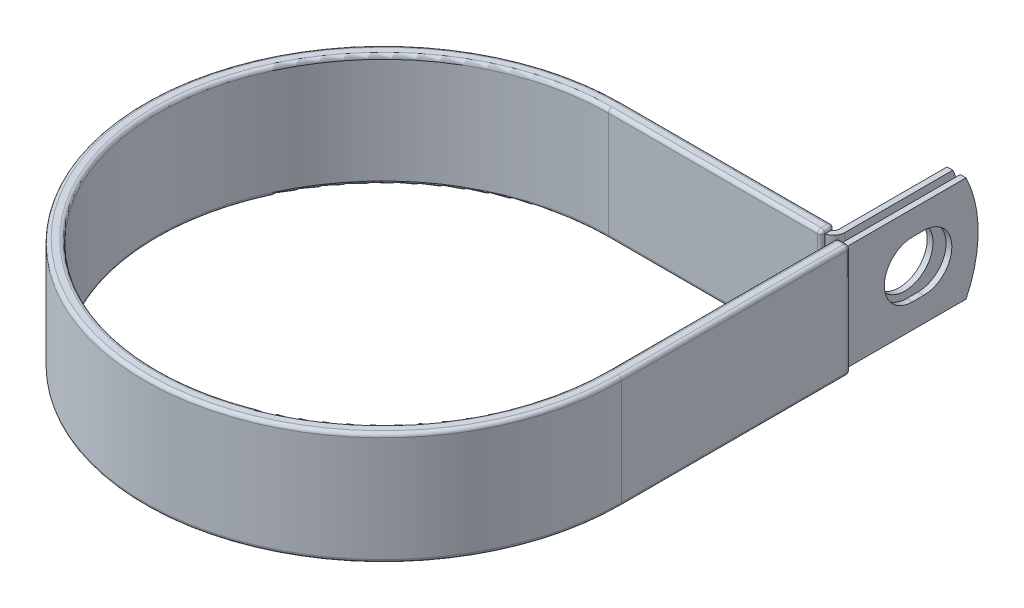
ISO-10303-21;
HEADER;
FILE_DESCRIPTION(('STEP AP214'),'2;1');
FILE_NAME('part.step','',(''),(''),'','','');
FILE_SCHEMA(('AUTOMOTIVE_DESIGN { 1 0 10303 214 1 1 1 1 }'));
ENDSEC;
DATA;
#1=APPLICATION_CONTEXT('core data for automotive mechanical design processes');
#2=APPLICATION_PROTOCOL_DEFINITION('international standard','automotive_design',2000,#1);
#3=PRODUCT_CONTEXT('',#1,'mechanical');
#4=PRODUCT('Part','Part','',(#3));
#5=PRODUCT_RELATED_PRODUCT_CATEGORY('part','',(#4));
#6=PRODUCT_DEFINITION_FORMATION('','',#4);
#7=PRODUCT_DEFINITION_CONTEXT('part definition',#1,'design');
#8=PRODUCT_DEFINITION('design','',#6,#7);
#9=PRODUCT_DEFINITION_SHAPE('','',#8);
#10=(LENGTH_UNIT() NAMED_UNIT(*) SI_UNIT(.MILLI.,.METRE.));
#11=(NAMED_UNIT(*) PLANE_ANGLE_UNIT() SI_UNIT($,.RADIAN.));
#12=(NAMED_UNIT(*) SI_UNIT($,.STERADIAN.) SOLID_ANGLE_UNIT());
#13=UNCERTAINTY_MEASURE_WITH_UNIT(LENGTH_MEASURE(1.E-05),#10,'distance_accuracy_value','');
#14=(GEOMETRIC_REPRESENTATION_CONTEXT(3) GLOBAL_UNCERTAINTY_ASSIGNED_CONTEXT((#13)) GLOBAL_UNIT_ASSIGNED_CONTEXT((#10,
#11,#12)) REPRESENTATION_CONTEXT('',''));
#15=CARTESIAN_POINT('',(0.,0.,0.));
#16=DIRECTION('',(0.,0.,1.));
#17=DIRECTION('',(1.,0.,0.));
#18=AXIS2_PLACEMENT_3D('',#15,#16,#17);
#19=CARTESIAN_POINT('',(46.84395,11.1125,-76.2));
#20=DIRECTION('',(1.,0.,0.));
#21=DIRECTION('',(0.,0.,-1.));
#22=AXIS2_PLACEMENT_3D('',#19,#20,#21);
#23=PLANE('',#22);
#24=CARTESIAN_POINT('',(46.84395,0.,-63.5));
#25=DIRECTION('',(1.,0.,0.));
#26=DIRECTION('',(0.,0.,-1.));
#27=AXIS2_PLACEMENT_3D('',#24,#25,#26);
#28=CIRCLE('',#27,5.9436);
#29=CARTESIAN_POINT('',(46.84395,0.,-69.4436));
#30=VERTEX_POINT('',#29);
#31=EDGE_CURVE('E460',#30,#30,#28,.F.);
#32=ORIENTED_EDGE('',*,*,#31,.T.);
#33=EDGE_LOOP('',(#32));
#34=FACE_BOUND('',#33,.T.);
#35=DIRECTION('',(0.,0.,1.));
#36=VECTOR('',#35,1.);
#37=CARTESIAN_POINT('',(46.84395,-11.1125,-76.2));
#38=LINE('',#37,#36);
#39=CARTESIAN_POINT('',(46.84395,-11.1125,-73.6401476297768));
#40=VERTEX_POINT('',#39);
#41=CARTESIAN_POINT('',(46.84395,-11.1125,-50.79619));
#42=VERTEX_POINT('',#41);
#43=EDGE_CURVE('E482',#40,#42,#38,.T.);
#44=ORIENTED_EDGE('',*,*,#43,.F.);
#45=CARTESIAN_POINT('',(46.84395,0.,-50.8));
#46=DIRECTION('',(1.,0.,0.));
#47=DIRECTION('',(0.,0.,-1.));
#48=AXIS2_PLACEMENT_3D('',#45,#46,#47);
#49=CIRCLE('',#48,25.4);
#50=CARTESIAN_POINT('',(46.84395,11.1125,-73.6401476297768));
#51=VERTEX_POINT('',#50);
#52=EDGE_CURVE('E419',#40,#51,#49,.T.);
#53=ORIENTED_EDGE('',*,*,#52,.T.);
#54=DIRECTION('',(0.,0.,1.));
#55=VECTOR('',#54,1.);
#56=CARTESIAN_POINT('',(46.84395,11.1125,-76.2));
#57=LINE('',#56,#55);
#58=CARTESIAN_POINT('',(46.84395,11.1125,-50.79619));
#59=VERTEX_POINT('',#58);
#60=EDGE_CURVE('E472',#51,#59,#57,.T.);
#61=ORIENTED_EDGE('',*,*,#60,.T.);
#62=DIRECTION('',(0.,-1.,0.));
#63=VECTOR('',#62,1.);
#64=CARTESIAN_POINT('',(46.84395,11.1125,-50.79619));
#65=LINE('',#64,#63);
#66=EDGE_CURVE('E489',#59,#42,#65,.T.);
#67=ORIENTED_EDGE('',*,*,#66,.T.);
#68=EDGE_LOOP('',(#44,#53,#61,#67));
#69=FACE_BOUND('',#68,.T.);
#70=ADVANCED_FACE('F54',(#34,#69),#23,.T.);
#71=CARTESIAN_POINT('',(45.62475,11.1125,-76.2));
#72=DIRECTION('',(1.,0.,0.));
#73=DIRECTION('',(0.,0.,-1.));
#74=AXIS2_PLACEMENT_3D('',#71,#72,#73);
#75=PLANE('',#74);
#76=CARTESIAN_POINT('',(45.62475,0.,-63.5));
#77=DIRECTION('',(-1.,0.,0.));
#78=DIRECTION('',(0.,0.,1.));
#79=AXIS2_PLACEMENT_3D('',#76,#77,#78);
#80=CIRCLE('',#79,5.9436);
#81=CARTESIAN_POINT('',(45.62475,0.,-57.5564));
#82=VERTEX_POINT('',#81);
#83=EDGE_CURVE('E457',#82,#82,#80,.T.);
#84=ORIENTED_EDGE('',*,*,#83,.F.);
#85=EDGE_LOOP('',(#84));
#86=FACE_BOUND('',#85,.T.);
#87=CARTESIAN_POINT('',(45.62475,0.,-50.8));
#88=DIRECTION('',(-1.,0.,0.));
#89=DIRECTION('',(0.,0.,1.));
#90=AXIS2_PLACEMENT_3D('',#87,#88,#89);
#91=CIRCLE('',#90,25.4);
#92=CARTESIAN_POINT('',(45.62475,11.1125,-73.6401476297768));
#93=VERTEX_POINT('',#92);
#94=CARTESIAN_POINT('',(45.62475,-11.1125,-73.6401476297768));
#95=VERTEX_POINT('',#94);
#96=EDGE_CURVE('E411',#93,#95,#91,.T.);
#97=ORIENTED_EDGE('',*,*,#96,.T.);
#98=DIRECTION('',(0.,0.,1.));
#99=VECTOR('',#98,1.);
#100=CARTESIAN_POINT('',(45.62475,-11.1125,-76.2));
#101=LINE('',#100,#99);
#102=CARTESIAN_POINT('',(45.62475,-11.1125,-50.79619));
#103=VERTEX_POINT('',#102);
#104=EDGE_CURVE('E484',#95,#103,#101,.T.);
#105=ORIENTED_EDGE('',*,*,#104,.T.);
#106=DIRECTION('',(0.,-1.,0.));
#107=VECTOR('',#106,1.);
#108=CARTESIAN_POINT('',(45.62475,11.1125,-50.79619));
#109=LINE('',#108,#107);
#110=CARTESIAN_POINT('',(45.62475,11.1125,-50.79619));
#111=VERTEX_POINT('',#110);
#112=EDGE_CURVE('E477',#111,#103,#109,.T.);
#113=ORIENTED_EDGE('',*,*,#112,.F.);
#114=DIRECTION('',(0.,0.,1.));
#115=VECTOR('',#114,1.);
#116=CARTESIAN_POINT('',(45.62475,11.1125,-76.2));
#117=LINE('',#116,#115);
#118=EDGE_CURVE('E474',#93,#111,#117,.T.);
#119=ORIENTED_EDGE('',*,*,#118,.F.);
#120=EDGE_LOOP('',(#97,#105,#113,#119));
#121=FACE_BOUND('',#120,.T.);
#122=ADVANCED_FACE('F788',(#86,#121),#75,.F.);
#123=CARTESIAN_POINT('',(0.,-11.1125,0.));
#124=DIRECTION('',(0.,1.,0.));
#125=DIRECTION('',(1.,0.,0.));
#126=AXIS2_PLACEMENT_3D('',#123,#124,#125);
#127=PLANE('',#126);
#128=CARTESIAN_POINT('',(44.46651,-11.1125,-50.79619));
#129=DIRECTION('',(0.,-1.,0.));
#130=DIRECTION('',(0.,0.,1.));
#131=AXIS2_PLACEMENT_3D('',#128,#129,#130);
#132=CIRCLE('',#131,2.37744);
#133=CARTESIAN_POINT('',(44.9897500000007,-11.1125,-48.4770434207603));
#134=VERTEX_POINT('',#133);
#135=EDGE_CURVE('E479',#42,#134,#132,.T.);
#136=ORIENTED_EDGE('',*,*,#135,.T.);
#137=DIRECTION('',(0.,0.,-1.));
#138=VECTOR('',#137,1.);
#139=CARTESIAN_POINT('',(44.9897500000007,-11.1125,-49.63795));
#140=LINE('',#139,#138);
#141=CARTESIAN_POINT('',(44.9897500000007,-11.1125,-49.6697));
#142=VERTEX_POINT('',#141);
#143=EDGE_CURVE('E368',#134,#142,#140,.T.);
#144=ORIENTED_EDGE('',*,*,#143,.T.);
#145=CARTESIAN_POINT('',(44.2277500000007,-11.1125,-49.6697));
#146=DIRECTION('',(0.,1.,0.));
#147=DIRECTION('',(0.,0.,1.));
#148=AXIS2_PLACEMENT_3D('',#145,#146,#147);
#149=CIRCLE('',#148,0.762);
#150=CARTESIAN_POINT('',(44.9843610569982,-11.1125,-49.7601638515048));
#151=VERTEX_POINT('',#150);
#152=EDGE_CURVE('E554',#142,#151,#149,.T.);
#153=ORIENTED_EDGE('',*,*,#152,.T.);
#154=CARTESIAN_POINT('',(44.46651,-11.1125,-50.79619));
#155=DIRECTION('',(0.,1.,0.));
#156=DIRECTION('',(1.,0.,0.));
#157=AXIS2_PLACEMENT_3D('',#154,#155,#156);
#158=CIRCLE('',#157,1.15824);
#159=EDGE_CURVE('E77',#103,#151,#158,.F.);
#160=ORIENTED_EDGE('',*,*,#159,.F.);
#161=ORIENTED_EDGE('',*,*,#104,.F.);
#162=DIRECTION('',(-1.,0.,0.));
#163=VECTOR('',#162,1.);
#164=CARTESIAN_POINT('',(49.63795,-11.1125,-73.6401476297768));
#165=LINE('',#164,#163);
#166=EDGE_CURVE('E498',#40,#95,#165,.T.);
#167=ORIENTED_EDGE('',*,*,#166,.F.);
#168=ORIENTED_EDGE('',*,*,#43,.T.);
#169=EDGE_LOOP('',(#136,#144,#153,#160,#161,#167,#168));
#170=FACE_BOUND('',#169,.T.);
#171=ADVANCED_FACE('F794',(#170),#127,.F.);
#172=CARTESIAN_POINT('',(0.,11.1125,0.));
#173=DIRECTION('',(0.,1.,0.));
#174=DIRECTION('',(1.,0.,0.));
#175=AXIS2_PLACEMENT_3D('',#172,#173,#174);
#176=PLANE('',#175);
#177=DIRECTION('',(0.,0.,-1.));
#178=VECTOR('',#177,1.);
#179=CARTESIAN_POINT('',(44.98975,11.1125,6.31078317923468E-13));
#180=LINE('',#179,#178);
#181=CARTESIAN_POINT('',(44.9897500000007,11.1125,-48.4770434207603));
#182=VERTEX_POINT('',#181);
#183=CARTESIAN_POINT('',(44.9897500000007,11.1125,-49.6697));
#184=VERTEX_POINT('',#183);
#185=EDGE_CURVE('E405',#182,#184,#180,.T.);
#186=ORIENTED_EDGE('',*,*,#185,.F.);
#187=CARTESIAN_POINT('',(44.46651,11.1125,-50.79619));
#188=DIRECTION('',(0.,-1.,0.));
#189=DIRECTION('',(0.,0.,1.));
#190=AXIS2_PLACEMENT_3D('',#187,#188,#189);
#191=CIRCLE('',#190,2.37744);
#192=EDGE_CURVE('E469',#59,#182,#191,.T.);
#193=ORIENTED_EDGE('',*,*,#192,.F.);
#194=ORIENTED_EDGE('',*,*,#60,.F.);
#195=DIRECTION('',(-1.,0.,0.));
#196=VECTOR('',#195,1.);
#197=CARTESIAN_POINT('',(49.63795,11.1125,-73.6401476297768));
#198=LINE('',#197,#196);
#199=EDGE_CURVE('E495',#51,#93,#198,.T.);
#200=ORIENTED_EDGE('',*,*,#199,.T.);
#201=ORIENTED_EDGE('',*,*,#118,.T.);
#202=CARTESIAN_POINT('',(44.46651,11.1125,-50.79619));
#203=DIRECTION('',(0.,1.,0.));
#204=DIRECTION('',(1.,0.,0.));
#205=AXIS2_PLACEMENT_3D('',#202,#203,#204);
#206=CIRCLE('',#205,1.15824);
#207=CARTESIAN_POINT('',(44.9843610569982,11.1125,-49.7601638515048));
#208=VERTEX_POINT('',#207);
#209=EDGE_CURVE('E70',#111,#208,#206,.F.);
#210=ORIENTED_EDGE('',*,*,#209,.T.);
#211=CARTESIAN_POINT('',(44.2277500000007,11.1125,-49.6697));
#212=DIRECTION('',(0.,1.,0.));
#213=DIRECTION('',(0.,0.,1.));
#214=AXIS2_PLACEMENT_3D('',#211,#212,#213);
#215=CIRCLE('',#214,0.762);
#216=EDGE_CURVE('E12',#208,#184,#215,.F.);
#217=ORIENTED_EDGE('',*,*,#216,.T.);
#218=EDGE_LOOP('',(#186,#193,#194,#200,#201,#210,#217));
#219=FACE_BOUND('',#218,.T.);
#220=ADVANCED_FACE('F802',(#219),#176,.T.);
#221=CARTESIAN_POINT('',(44.46651,11.1125,-50.79619));
#222=DIRECTION('',(0.,-1.,0.));
#223=DIRECTION('',(0.,0.,-1.));
#224=AXIS2_PLACEMENT_3D('',#221,#222,#223);
#225=CYLINDRICAL_SURFACE('',#224,2.37744);
#226=ORIENTED_EDGE('',*,*,#135,.F.);
#227=ORIENTED_EDGE('',*,*,#66,.F.);
#228=ORIENTED_EDGE('',*,*,#192,.T.);
#229=CARTESIAN_POINT('',(44.46651,11.1125,-50.79619));
#230=DIRECTION('',(0.,-1.,0.));
#231=DIRECTION('',(0.,0.,-1.));
#232=AXIS2_PLACEMENT_3D('',#229,#230,#231);
#233=CIRCLE('',#232,2.37744);
#234=CARTESIAN_POINT('',(44.46651,11.1125,-48.41875));
#235=VERTEX_POINT('',#234);
#236=EDGE_CURVE('E402',#235,#182,#233,.F.);
#237=ORIENTED_EDGE('',*,*,#236,.F.);
#238=DIRECTION('',(0.,-1.,0.));
#239=VECTOR('',#238,1.);
#240=CARTESIAN_POINT('',(44.46651,11.1125,-48.41875));
#241=LINE('',#240,#239);
#242=CARTESIAN_POINT('',(44.46651,-11.1125,-48.41875));
#243=VERTEX_POINT('',#242);
#244=EDGE_CURVE('E492',#235,#243,#241,.T.);
#245=ORIENTED_EDGE('',*,*,#244,.T.);
#246=CARTESIAN_POINT('',(44.46651,-11.1125,-50.79619));
#247=DIRECTION('',(0.,1.,0.));
#248=DIRECTION('',(-1.,0.,0.));
#249=AXIS2_PLACEMENT_3D('',#246,#247,#248);
#250=CIRCLE('',#249,2.37744);
#251=EDGE_CURVE('E400',#134,#243,#250,.F.);
#252=ORIENTED_EDGE('',*,*,#251,.F.);
#253=EDGE_LOOP('',(#226,#227,#228,#237,#245,#252));
#254=FACE_BOUND('',#253,.T.);
#255=ADVANCED_FACE('F799',(#254),#225,.T.);
#256=CARTESIAN_POINT('',(44.46651,11.1125,-50.79619));
#257=DIRECTION('',(0.,-1.,0.));
#258=DIRECTION('',(0.,0.,-1.));
#259=AXIS2_PLACEMENT_3D('',#256,#257,#258);
#260=CYLINDRICAL_SURFACE('',#259,1.15824);
#261=ORIENTED_EDGE('',*,*,#159,.T.);
#262=DIRECTION('',(0.,1.,0.));
#263=VECTOR('',#262,1.);
#264=CARTESIAN_POINT('',(44.9843610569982,-11.1125,-49.7601638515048));
#265=LINE('',#264,#263);
#266=EDGE_CURVE('E63',#151,#208,#265,.T.);
#267=ORIENTED_EDGE('',*,*,#266,.T.);
#268=ORIENTED_EDGE('',*,*,#209,.F.);
#269=ORIENTED_EDGE('',*,*,#112,.T.);
#270=EDGE_LOOP('',(#261,#267,#268,#269));
#271=FACE_BOUND('',#270,.T.);
#272=ADVANCED_FACE('F801',(#271),#260,.F.);
#273=CARTESIAN_POINT('',(63.6549894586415,0.,-63.5));
#274=DIRECTION('',(-1.,0.,0.));
#275=DIRECTION('',(0.,0.,1.));
#276=AXIS2_PLACEMENT_3D('',#273,#274,#275);
#277=CYLINDRICAL_SURFACE('',#276,5.9436);
#278=ORIENTED_EDGE('',*,*,#83,.T.);
#279=EDGE_LOOP('',(#278));
#280=FACE_BOUND('',#279,.T.);
#281=ORIENTED_EDGE('',*,*,#31,.F.);
#282=EDGE_LOOP('',(#281));
#283=FACE_BOUND('',#282,.T.);
#284=ADVANCED_FACE('F808',(#280,#283),#277,.F.);
#285=CARTESIAN_POINT('',(49.63795,0.,-50.8));
#286=DIRECTION('',(-1.,0.,0.));
#287=DIRECTION('',(0.,0.,1.));
#288=AXIS2_PLACEMENT_3D('',#285,#286,#287);
#289=CYLINDRICAL_SURFACE('',#288,25.4);
#290=ORIENTED_EDGE('',*,*,#52,.F.);
#291=ORIENTED_EDGE('',*,*,#166,.T.);
#292=ORIENTED_EDGE('',*,*,#96,.F.);
#293=ORIENTED_EDGE('',*,*,#199,.F.);
#294=EDGE_LOOP('',(#290,#291,#292,#293));
#295=FACE_BOUND('',#294,.T.);
#296=ADVANCED_FACE('F859',(#295),#289,.T.);
#297=CARTESIAN_POINT('',(6.79177441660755E-13,-11.1125,-48.41875));
#298=DIRECTION('',(0.,0.,1.));
#299=DIRECTION('',(1.,0.,0.));
#300=AXIS2_PLACEMENT_3D('',#297,#298,#299);
#301=PLANE('',#300);
#302=DIRECTION('',(1.,0.,0.));
#303=VECTOR('',#302,1.);
#304=CARTESIAN_POINT('',(6.79177441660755E-13,-11.1125,-48.41875));
#305=LINE('',#304,#303);
#306=CARTESIAN_POINT('',(44.9897500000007,-11.1125,-48.41875));
#307=VERTEX_POINT('',#306);
#308=EDGE_CURVE('E375',#243,#307,#305,.T.);
#309=ORIENTED_EDGE('',*,*,#308,.F.);
#310=ORIENTED_EDGE('',*,*,#244,.F.);
#311=DIRECTION('',(1.,0.,0.));
#312=VECTOR('',#311,1.);
#313=CARTESIAN_POINT('',(6.79177441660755E-13,11.1125,-48.41875));
#314=LINE('',#313,#312);
#315=CARTESIAN_POINT('',(44.9897500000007,11.1125,-48.41875));
#316=VERTEX_POINT('',#315);
#317=EDGE_CURVE('E377',#235,#316,#314,.T.);
#318=ORIENTED_EDGE('',*,*,#317,.T.);
#319=DIRECTION('',(0.,-1.,0.));
#320=VECTOR('',#319,1.);
#321=CARTESIAN_POINT('',(44.9897500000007,-11.1125,-48.41875));
#322=LINE('',#321,#320);
#323=EDGE_CURVE('E307',#316,#307,#322,.T.);
#324=ORIENTED_EDGE('',*,*,#323,.T.);
#325=EDGE_LOOP('',(#309,#310,#318,#324));
#326=FACE_BOUND('',#325,.T.);
#327=ADVANCED_FACE('F831',(#326),#301,.F.);
#328=CARTESIAN_POINT('',(44.9897500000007,-11.14425,-48.387));
#329=DIRECTION('',(1.,0.,0.));
#330=DIRECTION('',(0.,0.,-1.));
#331=AXIS2_PLACEMENT_3D('',#328,#329,#330);
#332=PLANE('',#331);
#333=DIRECTION('',(0.,0.,-1.));
#334=VECTOR('',#333,1.);
#335=CARTESIAN_POINT('',(44.9897500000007,-11.14425,-49.6697));
#336=LINE('',#335,#334);
#337=CARTESIAN_POINT('',(44.9897500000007,-11.14425,-48.387));
#338=VERTEX_POINT('',#337);
#339=CARTESIAN_POINT('',(44.9897500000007,-11.14425,-49.6697));
#340=VERTEX_POINT('',#339);
#341=EDGE_CURVE('E508',#338,#340,#336,.T.);
#342=ORIENTED_EDGE('',*,*,#341,.T.);
#343=DIRECTION('',(0.,1.,0.));
#344=VECTOR('',#343,1.);
#345=CARTESIAN_POINT('',(44.9897500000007,-11.14425,-49.6697));
#346=LINE('',#345,#344);
#347=EDGE_CURVE('E512',#340,#142,#346,.T.);
#348=ORIENTED_EDGE('',*,*,#347,.T.);
#349=ORIENTED_EDGE('',*,*,#143,.F.);
#350=EDGE_CURVE('E369',#307,#134,#140,.T.);
#351=ORIENTED_EDGE('',*,*,#350,.F.);
#352=ORIENTED_EDGE('',*,*,#323,.F.);
#353=DIRECTION('',(0.,0.,1.));
#354=VECTOR('',#353,1.);
#355=CARTESIAN_POINT('',(44.9897500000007,11.1125,-48.41875));
#356=LINE('',#355,#354);
#357=EDGE_CURVE('E372',#182,#316,#356,.T.);
#358=ORIENTED_EDGE('',*,*,#357,.F.);
#359=ORIENTED_EDGE('',*,*,#185,.T.);
#360=DIRECTION('',(0.,1.,0.));
#361=VECTOR('',#360,1.);
#362=CARTESIAN_POINT('',(44.9897500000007,-11.14425,-49.6697));
#363=LINE('',#362,#361);
#364=CARTESIAN_POINT('',(44.9897500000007,11.14425,-49.6697));
#365=VERTEX_POINT('',#364);
#366=EDGE_CURVE('E510',#184,#365,#363,.T.);
#367=ORIENTED_EDGE('',*,*,#366,.T.);
#368=DIRECTION('',(0.,0.,1.));
#369=VECTOR('',#368,1.);
#370=CARTESIAN_POINT('',(44.9897500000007,11.14425,-48.387));
#371=LINE('',#370,#369);
#372=CARTESIAN_POINT('',(44.9897500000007,11.14425,-48.387));
#373=VERTEX_POINT('',#372);
#374=EDGE_CURVE('E504',#365,#373,#371,.T.);
#375=ORIENTED_EDGE('',*,*,#374,.T.);
#376=DIRECTION('',(0.,-1.,0.));
#377=VECTOR('',#376,1.);
#378=CARTESIAN_POINT('',(44.9897500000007,-11.14425,-48.387));
#379=LINE('',#378,#377);
#380=EDGE_CURVE('E506',#373,#338,#379,.T.);
#381=ORIENTED_EDGE('',*,*,#380,.T.);
#382=EDGE_LOOP('',(#342,#348,#349,#351,#352,#358,#359,#367,#375,#381));
#383=FACE_BOUND('',#382,.T.);
#384=ADVANCED_FACE('F827',(#383),#332,.T.);
#385=CARTESIAN_POINT('',(6.96724714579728E-13,-11.14425,-49.6697));
#386=DIRECTION('',(1.,0.,0.));
#387=DIRECTION('',(0.,0.,-1.));
#388=AXIS2_PLACEMENT_3D('',#385,#386,#387);
#389=CYLINDRICAL_SURFACE('',#388,0.761999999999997);
#390=DIRECTION('',(1.,0.,0.));
#391=VECTOR('',#390,1.);
#392=CARTESIAN_POINT('',(7.07413408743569E-13,-11.14425,-50.4317));
#393=LINE('',#392,#391);
#394=CARTESIAN_POINT('',(7.07413408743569E-13,-11.14425,-50.4317));
#395=VERTEX_POINT('',#394);
#396=CARTESIAN_POINT('',(44.2277500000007,-11.14425,-50.4317));
#397=VERTEX_POINT('',#396);
#398=EDGE_CURVE('E394',#395,#397,#393,.T.);
#399=ORIENTED_EDGE('',*,*,#398,.T.);
#400=CARTESIAN_POINT('',(44.2277500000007,-11.14425,-49.6697));
#401=DIRECTION('',(1.,0.,0.));
#402=DIRECTION('',(0.,0.,-1.));
#403=AXIS2_PLACEMENT_3D('',#400,#401,#402);
#404=CIRCLE('',#403,0.761999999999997);
#405=CARTESIAN_POINT('',(44.2277500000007,-11.90625,-49.6697));
#406=VERTEX_POINT('',#405);
#407=EDGE_CURVE('E517',#397,#406,#404,.F.);
#408=ORIENTED_EDGE('',*,*,#407,.T.);
#409=DIRECTION('',(1.,0.,0.));
#410=VECTOR('',#409,1.);
#411=CARTESIAN_POINT('',(6.96724714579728E-13,-11.90625,-49.6697));
#412=LINE('',#411,#410);
#413=CARTESIAN_POINT('',(6.96724714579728E-13,-11.90625,-49.6697));
#414=VERTEX_POINT('',#413);
#415=EDGE_CURVE('E397',#414,#406,#412,.T.);
#416=ORIENTED_EDGE('',*,*,#415,.F.);
#417=CARTESIAN_POINT('',(6.96724714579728E-13,-11.14425,-49.6697));
#418=DIRECTION('',(1.,0.,0.));
#419=DIRECTION('',(0.,0.,1.));
#420=AXIS2_PLACEMENT_3D('',#417,#418,#419);
#421=CIRCLE('',#420,0.761999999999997);
#422=EDGE_CURVE('E345',#414,#395,#421,.T.);
#423=ORIENTED_EDGE('',*,*,#422,.T.);
#424=EDGE_LOOP('',(#399,#408,#416,#423));
#425=FACE_BOUND('',#424,.T.);
#426=ADVANCED_FACE('F670',(#425),#389,.T.);
#427=CARTESIAN_POINT('',(7.07413408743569E-13,11.14425,-50.4317));
#428=DIRECTION('',(0.,0.,-1.));
#429=DIRECTION('',(0.,1.,0.));
#430=AXIS2_PLACEMENT_3D('',#427,#428,#429);
#431=PLANE('',#430);
#432=DIRECTION('',(1.,0.,0.));
#433=VECTOR('',#432,1.);
#434=CARTESIAN_POINT('',(7.07413408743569E-13,11.14425,-50.4317));
#435=LINE('',#434,#433);
#436=CARTESIAN_POINT('',(7.07413408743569E-13,11.14425,-50.4317));
#437=VERTEX_POINT('',#436);
#438=CARTESIAN_POINT('',(44.2277500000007,11.14425,-50.4317));
#439=VERTEX_POINT('',#438);
#440=EDGE_CURVE('E391',#437,#439,#435,.T.);
#441=ORIENTED_EDGE('',*,*,#440,.T.);
#442=DIRECTION('',(0.,1.,0.));
#443=VECTOR('',#442,1.);
#444=CARTESIAN_POINT('',(44.2277500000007,11.14425,-50.4317));
#445=LINE('',#444,#443);
#446=EDGE_CURVE('E515',#439,#397,#445,.F.);
#447=ORIENTED_EDGE('',*,*,#446,.T.);
#448=ORIENTED_EDGE('',*,*,#398,.F.);
#449=DIRECTION('',(0.,1.,0.));
#450=VECTOR('',#449,1.);
#451=CARTESIAN_POINT('',(7.07413408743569E-13,11.14425,-50.4317));
#452=LINE('',#451,#450);
#453=EDGE_CURVE('E342',#395,#437,#452,.T.);
#454=ORIENTED_EDGE('',*,*,#453,.T.);
#455=EDGE_LOOP('',(#441,#447,#448,#454));
#456=FACE_BOUND('',#455,.T.);
#457=ADVANCED_FACE('F676',(#456),#431,.T.);
#458=CARTESIAN_POINT('',(6.96724714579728E-13,11.14425,-49.6697));
#459=DIRECTION('',(1.,0.,0.));
#460=DIRECTION('',(0.,0.,-1.));
#461=AXIS2_PLACEMENT_3D('',#458,#459,#460);
#462=CYLINDRICAL_SURFACE('',#461,0.762);
#463=DIRECTION('',(1.,0.,0.));
#464=VECTOR('',#463,1.);
#465=CARTESIAN_POINT('',(6.96724714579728E-13,11.90625,-49.6697));
#466=LINE('',#465,#464);
#467=CARTESIAN_POINT('',(6.96724714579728E-13,11.90625,-49.6697));
#468=VERTEX_POINT('',#467);
#469=CARTESIAN_POINT('',(44.2277500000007,11.90625,-49.6697));
#470=VERTEX_POINT('',#469);
#471=EDGE_CURVE('E388',#468,#470,#466,.T.);
#472=ORIENTED_EDGE('',*,*,#471,.T.);
#473=CARTESIAN_POINT('',(44.2277500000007,11.14425,-49.6697));
#474=DIRECTION('',(1.,0.,0.));
#475=DIRECTION('',(0.,0.,-1.));
#476=AXIS2_PLACEMENT_3D('',#473,#474,#475);
#477=CIRCLE('',#476,0.762);
#478=EDGE_CURVE('E501',#470,#439,#477,.F.);
#479=ORIENTED_EDGE('',*,*,#478,.T.);
#480=ORIENTED_EDGE('',*,*,#440,.F.);
#481=CARTESIAN_POINT('',(6.96724714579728E-13,11.14425,-49.6697));
#482=DIRECTION('',(1.,0.,0.));
#483=DIRECTION('',(0.,0.,1.));
#484=AXIS2_PLACEMENT_3D('',#481,#482,#483);
#485=CIRCLE('',#484,0.762);
#486=EDGE_CURVE('E339',#437,#468,#485,.T.);
#487=ORIENTED_EDGE('',*,*,#486,.T.);
#488=EDGE_LOOP('',(#472,#479,#480,#487));
#489=FACE_BOUND('',#488,.T.);
#490=ADVANCED_FACE('F680',(#489),#462,.T.);
#491=CARTESIAN_POINT('',(6.78732079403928E-13,11.14425,-48.387));
#492=DIRECTION('',(1.,0.,0.));
#493=DIRECTION('',(0.,0.,-1.));
#494=AXIS2_PLACEMENT_3D('',#491,#492,#493);
#495=CYLINDRICAL_SURFACE('',#494,0.761999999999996);
#496=DIRECTION('',(1.,0.,0.));
#497=VECTOR('',#496,1.);
#498=CARTESIAN_POINT('',(6.68043385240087E-13,11.14425,-47.625));
#499=LINE('',#498,#497);
#500=CARTESIAN_POINT('',(6.68043385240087E-13,11.14425,-47.625));
#501=VERTEX_POINT('',#500);
#502=CARTESIAN_POINT('',(44.2277500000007,11.14425,-47.625));
#503=VERTEX_POINT('',#502);
#504=EDGE_CURVE('E382',#501,#503,#499,.T.);
#505=ORIENTED_EDGE('',*,*,#504,.T.);
#506=CARTESIAN_POINT('',(44.2277500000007,11.14425,-48.387));
#507=DIRECTION('',(1.,0.,0.));
#508=DIRECTION('',(0.,0.,-1.));
#509=AXIS2_PLACEMENT_3D('',#506,#507,#508);
#510=CIRCLE('',#509,0.761999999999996);
#511=CARTESIAN_POINT('',(44.2277500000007,11.90625,-48.387));
#512=VERTEX_POINT('',#511);
#513=EDGE_CURVE('E527',#503,#512,#510,.F.);
#514=ORIENTED_EDGE('',*,*,#513,.T.);
#515=DIRECTION('',(1.,0.,0.));
#516=VECTOR('',#515,1.);
#517=CARTESIAN_POINT('',(6.78732079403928E-13,11.90625,-48.387));
#518=LINE('',#517,#516);
#519=CARTESIAN_POINT('',(6.78732079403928E-13,11.90625,-48.387));
#520=VERTEX_POINT('',#519);
#521=EDGE_CURVE('E385',#520,#512,#518,.T.);
#522=ORIENTED_EDGE('',*,*,#521,.F.);
#523=CARTESIAN_POINT('',(6.78732079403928E-13,11.14425,-48.387));
#524=DIRECTION('',(1.,0.,0.));
#525=DIRECTION('',(0.,0.,1.));
#526=AXIS2_PLACEMENT_3D('',#523,#524,#525);
#527=CIRCLE('',#526,0.761999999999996);
#528=EDGE_CURVE('E336',#520,#501,#527,.T.);
#529=ORIENTED_EDGE('',*,*,#528,.T.);
#530=EDGE_LOOP('',(#505,#514,#522,#529));
#531=FACE_BOUND('',#530,.T.);
#532=ADVANCED_FACE('F721',(#531),#495,.T.);
#533=CARTESIAN_POINT('',(6.68043385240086E-13,-11.14425,-47.625));
#534=DIRECTION('',(0.,0.,1.));
#535=DIRECTION('',(0.,-1.,0.));
#536=AXIS2_PLACEMENT_3D('',#533,#534,#535);
#537=PLANE('',#536);
#538=DIRECTION('',(1.,0.,0.));
#539=VECTOR('',#538,1.);
#540=CARTESIAN_POINT('',(6.68043385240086E-13,-11.14425,-47.625));
#541=LINE('',#540,#539);
#542=CARTESIAN_POINT('',(6.68043385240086E-13,-11.14425,-47.625));
#543=VERTEX_POINT('',#542);
#544=CARTESIAN_POINT('',(44.2277500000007,-11.14425,-47.625));
#545=VERTEX_POINT('',#544);
#546=EDGE_CURVE('E379',#543,#545,#541,.T.);
#547=ORIENTED_EDGE('',*,*,#546,.T.);
#548=DIRECTION('',(0.,-1.,0.));
#549=VECTOR('',#548,1.);
#550=CARTESIAN_POINT('',(44.2277500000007,-11.14425,-47.625));
#551=LINE('',#550,#549);
#552=EDGE_CURVE('E525',#545,#503,#551,.F.);
#553=ORIENTED_EDGE('',*,*,#552,.T.);
#554=ORIENTED_EDGE('',*,*,#504,.F.);
#555=DIRECTION('',(0.,-1.,0.));
#556=VECTOR('',#555,1.);
#557=CARTESIAN_POINT('',(6.68043385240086E-13,-11.14425,-47.625));
#558=LINE('',#557,#556);
#559=EDGE_CURVE('E327',#501,#543,#558,.T.);
#560=ORIENTED_EDGE('',*,*,#559,.T.);
#561=EDGE_LOOP('',(#547,#553,#554,#560));
#562=FACE_BOUND('',#561,.T.);
#563=ADVANCED_FACE('F719',(#562),#537,.T.);
#564=CARTESIAN_POINT('',(6.78732079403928E-13,-11.14425,-48.387));
#565=DIRECTION('',(1.,0.,0.));
#566=DIRECTION('',(0.,0.,-1.));
#567=AXIS2_PLACEMENT_3D('',#564,#565,#566);
#568=CYLINDRICAL_SURFACE('',#567,0.762000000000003);
#569=DIRECTION('',(1.,0.,0.));
#570=VECTOR('',#569,1.);
#571=CARTESIAN_POINT('',(6.78732079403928E-13,-11.90625,-48.387));
#572=LINE('',#571,#570);
#573=CARTESIAN_POINT('',(6.78732079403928E-13,-11.90625,-48.387));
#574=VERTEX_POINT('',#573);
#575=CARTESIAN_POINT('',(44.2277500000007,-11.90625,-48.387));
#576=VERTEX_POINT('',#575);
#577=EDGE_CURVE('E303',#574,#576,#572,.T.);
#578=ORIENTED_EDGE('',*,*,#577,.T.);
#579=CARTESIAN_POINT('',(44.2277500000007,-11.14425,-48.387));
#580=DIRECTION('',(1.,0.,0.));
#581=DIRECTION('',(0.,0.,-1.));
#582=AXIS2_PLACEMENT_3D('',#579,#580,#581);
#583=CIRCLE('',#582,0.762000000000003);
#584=EDGE_CURVE('E523',#576,#545,#583,.F.);
#585=ORIENTED_EDGE('',*,*,#584,.T.);
#586=ORIENTED_EDGE('',*,*,#546,.F.);
#587=CARTESIAN_POINT('',(6.78732079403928E-13,-11.14425,-48.387));
#588=DIRECTION('',(1.,0.,0.));
#589=DIRECTION('',(0.,0.,-1.));
#590=AXIS2_PLACEMENT_3D('',#587,#588,#589);
#591=CIRCLE('',#590,0.762000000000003);
#592=EDGE_CURVE('E324',#543,#574,#591,.T.);
#593=ORIENTED_EDGE('',*,*,#592,.T.);
#594=EDGE_LOOP('',(#578,#585,#586,#593));
#595=FACE_BOUND('',#594,.T.);
#596=ADVANCED_FACE('F709',(#595),#568,.T.);
#597=CARTESIAN_POINT('',(0.,-11.14425,0.));
#598=DIRECTION('',(0.,-1.,0.));
#599=DIRECTION('',(0.,0.,-1.));
#600=AXIS2_PLACEMENT_3D('',#597,#598,#599);
#601=TOROIDAL_SURFACE('',#600,49.6697,0.761999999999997);
#602=CARTESIAN_POINT('',(49.6697,-11.14425,0.));
#603=DIRECTION('',(0.,0.,1.));
#604=DIRECTION('',(-1.,0.,0.));
#605=AXIS2_PLACEMENT_3D('',#602,#603,#604);
#606=CIRCLE('',#605,0.761999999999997);
#607=CARTESIAN_POINT('',(49.6697,-11.90625,0.));
#608=VERTEX_POINT('',#607);
#609=CARTESIAN_POINT('',(50.4317,-11.14425,0.));
#610=VERTEX_POINT('',#609);
#611=EDGE_CURVE('E318',#608,#610,#606,.T.);
#612=ORIENTED_EDGE('',*,*,#611,.T.);
#613=CARTESIAN_POINT('',(0.,-11.14425,0.));
#614=DIRECTION('',(0.,-1.,0.));
#615=DIRECTION('',(0.,0.,-1.));
#616=AXIS2_PLACEMENT_3D('',#613,#614,#615);
#617=CIRCLE('',#616,50.4317);
#618=EDGE_CURVE('E361',#610,#395,#617,.T.);
#619=ORIENTED_EDGE('',*,*,#618,.T.);
#620=ORIENTED_EDGE('',*,*,#422,.F.);
#621=CARTESIAN_POINT('',(0.,-11.90625,0.));
#622=DIRECTION('',(0.,-1.,0.));
#623=DIRECTION('',(0.,0.,-1.));
#624=AXIS2_PLACEMENT_3D('',#621,#622,#623);
#625=CIRCLE('',#624,49.6697);
#626=EDGE_CURVE('E308',#608,#414,#625,.T.);
#627=ORIENTED_EDGE('',*,*,#626,.F.);
#628=EDGE_LOOP('',(#612,#619,#620,#627));
#629=FACE_BOUND('',#628,.T.);
#630=ADVANCED_FACE('F667',(#629),#601,.T.);
#631=CARTESIAN_POINT('',(0.,11.1125,0.));
#632=DIRECTION('',(0.,-1.,0.));
#633=DIRECTION('',(0.,0.,-1.));
#634=AXIS2_PLACEMENT_3D('',#631,#632,#633);
#635=CYLINDRICAL_SURFACE('',#634,50.4317);
#636=DIRECTION('',(0.,1.,0.));
#637=VECTOR('',#636,1.);
#638=CARTESIAN_POINT('',(50.4317,11.14425,0.));
#639=LINE('',#638,#637);
#640=CARTESIAN_POINT('',(50.4317,11.14425,0.));
#641=VERTEX_POINT('',#640);
#642=EDGE_CURVE('E655',#610,#641,#639,.T.);
#643=ORIENTED_EDGE('',*,*,#642,.T.);
#644=CARTESIAN_POINT('',(0.,11.14425,0.));
#645=DIRECTION('',(0.,-1.,0.));
#646=DIRECTION('',(0.,0.,-1.));
#647=AXIS2_PLACEMENT_3D('',#644,#645,#646);
#648=CIRCLE('',#647,50.4317);
#649=EDGE_CURVE('E358',#641,#437,#648,.T.);
#650=ORIENTED_EDGE('',*,*,#649,.T.);
#651=ORIENTED_EDGE('',*,*,#453,.F.);
#652=ORIENTED_EDGE('',*,*,#618,.F.);
#653=EDGE_LOOP('',(#643,#650,#651,#652));
#654=FACE_BOUND('',#653,.T.);
#655=ADVANCED_FACE('F673',(#654),#635,.T.);
#656=CARTESIAN_POINT('',(0.,11.14425,0.));
#657=DIRECTION('',(0.,-1.,0.));
#658=DIRECTION('',(0.,0.,-1.));
#659=AXIS2_PLACEMENT_3D('',#656,#657,#658);
#660=TOROIDAL_SURFACE('',#659,49.6697,0.762);
#661=CARTESIAN_POINT('',(49.6697,11.14425,0.));
#662=DIRECTION('',(0.,0.,1.));
#663=DIRECTION('',(-1.,0.,0.));
#664=AXIS2_PLACEMENT_3D('',#661,#662,#663);
#665=CIRCLE('',#664,0.762);
#666=CARTESIAN_POINT('',(49.6697,11.90625,0.));
#667=VERTEX_POINT('',#666);
#668=EDGE_CURVE('E734',#641,#667,#665,.T.);
#669=ORIENTED_EDGE('',*,*,#668,.T.);
#670=CARTESIAN_POINT('',(0.,11.90625,0.));
#671=DIRECTION('',(0.,-1.,0.));
#672=DIRECTION('',(0.,0.,-1.));
#673=AXIS2_PLACEMENT_3D('',#670,#671,#672);
#674=CIRCLE('',#673,49.6697);
#675=EDGE_CURVE('E355',#667,#468,#674,.T.);
#676=ORIENTED_EDGE('',*,*,#675,.T.);
#677=ORIENTED_EDGE('',*,*,#486,.F.);
#678=ORIENTED_EDGE('',*,*,#649,.F.);
#679=EDGE_LOOP('',(#669,#676,#677,#678));
#680=FACE_BOUND('',#679,.T.);
#681=ADVANCED_FACE('F678',(#680),#660,.T.);
#682=CARTESIAN_POINT('',(0.,11.14425,0.));
#683=DIRECTION('',(0.,-1.,0.));
#684=DIRECTION('',(0.,0.,-1.));
#685=AXIS2_PLACEMENT_3D('',#682,#683,#684);
#686=TOROIDAL_SURFACE('',#685,48.387,0.761999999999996);
#687=CARTESIAN_POINT('',(48.387,11.14425,0.));
#688=DIRECTION('',(0.,0.,1.));
#689=DIRECTION('',(-1.,0.,0.));
#690=AXIS2_PLACEMENT_3D('',#687,#688,#689);
#691=CIRCLE('',#690,0.761999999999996);
#692=CARTESIAN_POINT('',(48.387,11.90625,0.));
#693=VERTEX_POINT('',#692);
#694=CARTESIAN_POINT('',(47.625,11.14425,0.));
#695=VERTEX_POINT('',#694);
#696=EDGE_CURVE('E730',#693,#695,#691,.T.);
#697=ORIENTED_EDGE('',*,*,#696,.T.);
#698=CARTESIAN_POINT('',(0.,11.14425,0.));
#699=DIRECTION('',(0.,-1.,0.));
#700=DIRECTION('',(0.,0.,-1.));
#701=AXIS2_PLACEMENT_3D('',#698,#699,#700);
#702=CIRCLE('',#701,47.625);
#703=EDGE_CURVE('E349',#695,#501,#702,.T.);
#704=ORIENTED_EDGE('',*,*,#703,.T.);
#705=ORIENTED_EDGE('',*,*,#528,.F.);
#706=CARTESIAN_POINT('',(0.,11.90625,0.));
#707=DIRECTION('',(0.,-1.,0.));
#708=DIRECTION('',(0.,0.,-1.));
#709=AXIS2_PLACEMENT_3D('',#706,#707,#708);
#710=CIRCLE('',#709,48.387);
#711=EDGE_CURVE('E352',#693,#520,#710,.T.);
#712=ORIENTED_EDGE('',*,*,#711,.F.);
#713=EDGE_LOOP('',(#697,#704,#705,#712));
#714=FACE_BOUND('',#713,.T.);
#715=ADVANCED_FACE('F728',(#714),#686,.T.);
#716=CARTESIAN_POINT('',(0.,11.1125,0.));
#717=DIRECTION('',(0.,-1.,0.));
#718=DIRECTION('',(0.,0.,-1.));
#719=AXIS2_PLACEMENT_3D('',#716,#717,#718);
#720=CYLINDRICAL_SURFACE('',#719,47.625);
#721=DIRECTION('',(0.,-1.,0.));
#722=VECTOR('',#721,1.);
#723=CARTESIAN_POINT('',(47.625,-11.14425,0.));
#724=LINE('',#723,#722);
#725=CARTESIAN_POINT('',(47.625,-11.14425,0.));
#726=VERTEX_POINT('',#725);
#727=EDGE_CURVE('E733',#695,#726,#724,.T.);
#728=ORIENTED_EDGE('',*,*,#727,.T.);
#729=CARTESIAN_POINT('',(0.,-11.14425,0.));
#730=DIRECTION('',(0.,-1.,0.));
#731=DIRECTION('',(0.,0.,-1.));
#732=AXIS2_PLACEMENT_3D('',#729,#730,#731);
#733=CIRCLE('',#732,47.625);
#734=EDGE_CURVE('E314',#726,#543,#733,.T.);
#735=ORIENTED_EDGE('',*,*,#734,.T.);
#736=ORIENTED_EDGE('',*,*,#559,.F.);
#737=ORIENTED_EDGE('',*,*,#703,.F.);
#738=EDGE_LOOP('',(#728,#735,#736,#737));
#739=FACE_BOUND('',#738,.T.);
#740=ADVANCED_FACE('F726',(#739),#720,.F.);
#741=CARTESIAN_POINT('',(0.,-11.14425,0.));
#742=DIRECTION('',(0.,-1.,0.));
#743=DIRECTION('',(0.,0.,-1.));
#744=AXIS2_PLACEMENT_3D('',#741,#742,#743);
#745=TOROIDAL_SURFACE('',#744,48.387,0.762000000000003);
#746=CARTESIAN_POINT('',(48.387,-11.14425,0.));
#747=DIRECTION('',(0.,0.,1.));
#748=DIRECTION('',(1.,0.,0.));
#749=AXIS2_PLACEMENT_3D('',#746,#747,#748);
#750=CIRCLE('',#749,0.762000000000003);
#751=CARTESIAN_POINT('',(48.387,-11.90625,0.));
#752=VERTEX_POINT('',#751);
#753=EDGE_CURVE('E311',#726,#752,#750,.T.);
#754=ORIENTED_EDGE('',*,*,#753,.T.);
#755=CARTESIAN_POINT('',(0.,-11.90625,0.));
#756=DIRECTION('',(0.,-1.,0.));
#757=DIRECTION('',(0.,0.,-1.));
#758=AXIS2_PLACEMENT_3D('',#755,#756,#757);
#759=CIRCLE('',#758,48.387);
#760=EDGE_CURVE('E295',#752,#574,#759,.T.);
#761=ORIENTED_EDGE('',*,*,#760,.T.);
#762=ORIENTED_EDGE('',*,*,#592,.F.);
#763=ORIENTED_EDGE('',*,*,#734,.F.);
#764=EDGE_LOOP('',(#754,#761,#762,#763));
#765=FACE_BOUND('',#764,.T.);
#766=ADVANCED_FACE('F312',(#765),#745,.T.);
#767=CARTESIAN_POINT('',(48.387,-11.14425,0.));
#768=DIRECTION('',(0.,0.,-1.));
#769=DIRECTION('',(-1.,0.,0.));
#770=AXIS2_PLACEMENT_3D('',#767,#768,#769);
#771=CYLINDRICAL_SURFACE('',#770,0.762000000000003);
#772=DIRECTION('',(0.,0.,-1.));
#773=VECTOR('',#772,1.);
#774=CARTESIAN_POINT('',(47.625,-11.14425,0.));
#775=LINE('',#774,#773);
#776=CARTESIAN_POINT('',(47.625,-11.14425,-47.65675));
#777=VERTEX_POINT('',#776);
#778=EDGE_CURVE('E741',#726,#777,#775,.T.);
#779=ORIENTED_EDGE('',*,*,#778,.T.);
#780=CARTESIAN_POINT('',(48.387,-11.14425,-47.65675));
#781=DIRECTION('',(0.,0.,-1.));
#782=DIRECTION('',(-1.,0.,0.));
#783=AXIS2_PLACEMENT_3D('',#780,#781,#782);
#784=CIRCLE('',#783,0.762000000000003);
#785=CARTESIAN_POINT('',(48.387,-11.90625,-47.65675));
#786=VERTEX_POINT('',#785);
#787=EDGE_CURVE('E323',#777,#786,#784,.F.);
#788=ORIENTED_EDGE('',*,*,#787,.T.);
#789=DIRECTION('',(0.,0.,-1.));
#790=VECTOR('',#789,1.);
#791=CARTESIAN_POINT('',(48.387,-11.90625,0.));
#792=LINE('',#791,#790);
#793=EDGE_CURVE('E300',#752,#786,#792,.T.);
#794=ORIENTED_EDGE('',*,*,#793,.F.);
#795=ORIENTED_EDGE('',*,*,#753,.F.);
#796=EDGE_LOOP('',(#779,#788,#794,#795));
#797=FACE_BOUND('',#796,.T.);
#798=ADVANCED_FACE('F321',(#797),#771,.T.);
#799=CARTESIAN_POINT('',(49.6697,-11.90625,0.));
#800=DIRECTION('',(0.,1.,0.));
#801=DIRECTION('',(-1.,0.,0.));
#802=AXIS2_PLACEMENT_3D('',#799,#800,#801);
#803=PLANE('',#802);
#804=ORIENTED_EDGE('',*,*,#415,.T.);
#805=DIRECTION('',(0.,0.,-1.));
#806=VECTOR('',#805,1.);
#807=CARTESIAN_POINT('',(44.2277500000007,-11.90625,-48.387));
#808=LINE('',#807,#806);
#809=EDGE_CURVE('E521',#406,#576,#808,.F.);
#810=ORIENTED_EDGE('',*,*,#809,.T.);
#811=ORIENTED_EDGE('',*,*,#577,.F.);
#812=ORIENTED_EDGE('',*,*,#760,.F.);
#813=ORIENTED_EDGE('',*,*,#793,.T.);
#814=DIRECTION('',(1.,0.,0.));
#815=VECTOR('',#814,1.);
#816=CARTESIAN_POINT('',(49.6697,-11.90625,-47.65675));
#817=LINE('',#816,#815);
#818=CARTESIAN_POINT('',(49.6697,-11.90625,-47.65675));
#819=VERTEX_POINT('',#818);
#820=EDGE_CURVE('E519',#786,#819,#817,.T.);
#821=ORIENTED_EDGE('',*,*,#820,.T.);
#822=DIRECTION('',(0.,0.,-1.));
#823=VECTOR('',#822,1.);
#824=CARTESIAN_POINT('',(49.6697,-11.90625,0.));
#825=LINE('',#824,#823);
#826=EDGE_CURVE('E325',#608,#819,#825,.T.);
#827=ORIENTED_EDGE('',*,*,#826,.F.);
#828=ORIENTED_EDGE('',*,*,#626,.T.);
#829=EDGE_LOOP('',(#804,#810,#811,#812,#813,#821,#827,#828));
#830=FACE_BOUND('',#829,.T.);
#831=ADVANCED_FACE('F298',(#830),#803,.F.);
#832=CARTESIAN_POINT('',(49.6697,-11.14425,0.));
#833=DIRECTION('',(0.,0.,-1.));
#834=DIRECTION('',(-1.,0.,0.));
#835=AXIS2_PLACEMENT_3D('',#832,#833,#834);
#836=CYLINDRICAL_SURFACE('',#835,0.761999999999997);
#837=ORIENTED_EDGE('',*,*,#826,.T.);
#838=CARTESIAN_POINT('',(49.6697,-11.14425,-47.65675));
#839=DIRECTION('',(0.,0.,-1.));
#840=DIRECTION('',(-1.,0.,0.));
#841=AXIS2_PLACEMENT_3D('',#838,#839,#840);
#842=CIRCLE('',#841,0.761999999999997);
#843=CARTESIAN_POINT('',(50.4317,-11.14425,-47.65675));
#844=VERTEX_POINT('',#843);
#845=EDGE_CURVE('E543',#819,#844,#842,.F.);
#846=ORIENTED_EDGE('',*,*,#845,.T.);
#847=DIRECTION('',(0.,0.,-1.));
#848=VECTOR('',#847,1.);
#849=CARTESIAN_POINT('',(50.4317,-11.14425,0.));
#850=LINE('',#849,#848);
#851=EDGE_CURVE('E330',#610,#844,#850,.T.);
#852=ORIENTED_EDGE('',*,*,#851,.F.);
#853=ORIENTED_EDGE('',*,*,#611,.F.);
#854=EDGE_LOOP('',(#837,#846,#852,#853));
#855=FACE_BOUND('',#854,.T.);
#856=ADVANCED_FACE('F661',(#855),#836,.T.);
#857=CARTESIAN_POINT('',(50.4317,11.14425,0.));
#858=DIRECTION('',(-1.,0.,0.));
#859=DIRECTION('',(0.,-1.,0.));
#860=AXIS2_PLACEMENT_3D('',#857,#858,#859);
#861=PLANE('',#860);
#862=ORIENTED_EDGE('',*,*,#851,.T.);
#863=DIRECTION('',(0.,1.,0.));
#864=VECTOR('',#863,1.);
#865=CARTESIAN_POINT('',(50.4317,11.14425,-47.65675));
#866=LINE('',#865,#864);
#867=CARTESIAN_POINT('',(50.4317,11.14425,-47.65675));
#868=VERTEX_POINT('',#867);
#869=EDGE_CURVE('E532',#844,#868,#866,.T.);
#870=ORIENTED_EDGE('',*,*,#869,.T.);
#871=DIRECTION('',(0.,0.,-1.));
#872=VECTOR('',#871,1.);
#873=CARTESIAN_POINT('',(50.4317,11.14425,0.));
#874=LINE('',#873,#872);
#875=EDGE_CURVE('E640',#641,#868,#874,.T.);
#876=ORIENTED_EDGE('',*,*,#875,.F.);
#877=ORIENTED_EDGE('',*,*,#642,.F.);
#878=EDGE_LOOP('',(#862,#870,#876,#877));
#879=FACE_BOUND('',#878,.T.);
#880=ADVANCED_FACE('F653',(#879),#861,.F.);
#881=CARTESIAN_POINT('',(49.6697,11.14425,0.));
#882=DIRECTION('',(0.,0.,-1.));
#883=DIRECTION('',(-1.,0.,0.));
#884=AXIS2_PLACEMENT_3D('',#881,#882,#883);
#885=CYLINDRICAL_SURFACE('',#884,0.762);
#886=ORIENTED_EDGE('',*,*,#875,.T.);
#887=CARTESIAN_POINT('',(49.6697,11.14425,-47.65675));
#888=DIRECTION('',(0.,0.,-1.));
#889=DIRECTION('',(-1.,0.,0.));
#890=AXIS2_PLACEMENT_3D('',#887,#888,#889);
#891=CIRCLE('',#890,0.762);
#892=CARTESIAN_POINT('',(49.6697,11.90625,-47.65675));
#893=VERTEX_POINT('',#892);
#894=EDGE_CURVE('E529',#868,#893,#891,.F.);
#895=ORIENTED_EDGE('',*,*,#894,.T.);
#896=DIRECTION('',(0.,0.,-1.));
#897=VECTOR('',#896,1.);
#898=CARTESIAN_POINT('',(49.6697,11.90625,0.));
#899=LINE('',#898,#897);
#900=EDGE_CURVE('E638',#667,#893,#899,.T.);
#901=ORIENTED_EDGE('',*,*,#900,.F.);
#902=ORIENTED_EDGE('',*,*,#668,.F.);
#903=EDGE_LOOP('',(#886,#895,#901,#902));
#904=FACE_BOUND('',#903,.T.);
#905=ADVANCED_FACE('F636',(#904),#885,.T.);
#906=CARTESIAN_POINT('',(48.387,11.90625,0.));
#907=DIRECTION('',(0.,-1.,0.));
#908=DIRECTION('',(0.,0.,-1.));
#909=AXIS2_PLACEMENT_3D('',#906,#907,#908);
#910=PLANE('',#909);
#911=ORIENTED_EDGE('',*,*,#521,.T.);
#912=DIRECTION('',(0.,0.,1.));
#913=VECTOR('',#912,1.);
#914=CARTESIAN_POINT('',(44.2277500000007,11.90625,-49.6697));
#915=LINE('',#914,#913);
#916=EDGE_CURVE('E552',#512,#470,#915,.F.);
#917=ORIENTED_EDGE('',*,*,#916,.T.);
#918=ORIENTED_EDGE('',*,*,#471,.F.);
#919=ORIENTED_EDGE('',*,*,#675,.F.);
#920=ORIENTED_EDGE('',*,*,#900,.T.);
#921=DIRECTION('',(-1.,0.,0.));
#922=VECTOR('',#921,1.);
#923=CARTESIAN_POINT('',(48.387,11.90625,-47.65675));
#924=LINE('',#923,#922);
#925=CARTESIAN_POINT('',(48.387,11.90625,-47.65675));
#926=VERTEX_POINT('',#925);
#927=EDGE_CURVE('E550',#893,#926,#924,.T.);
#928=ORIENTED_EDGE('',*,*,#927,.T.);
#929=DIRECTION('',(0.,0.,-1.));
#930=VECTOR('',#929,1.);
#931=CARTESIAN_POINT('',(48.387,11.90625,0.));
#932=LINE('',#931,#930);
#933=EDGE_CURVE('E643',#693,#926,#932,.T.);
#934=ORIENTED_EDGE('',*,*,#933,.F.);
#935=ORIENTED_EDGE('',*,*,#711,.T.);
#936=EDGE_LOOP('',(#911,#917,#918,#919,#920,#928,#934,#935));
#937=FACE_BOUND('',#936,.T.);
#938=ADVANCED_FACE('F641',(#937),#910,.F.);
#939=CARTESIAN_POINT('',(48.387,11.14425,0.));
#940=DIRECTION('',(0.,0.,-1.));
#941=DIRECTION('',(-1.,0.,0.));
#942=AXIS2_PLACEMENT_3D('',#939,#940,#941);
#943=CYLINDRICAL_SURFACE('',#942,0.761999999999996);
#944=ORIENTED_EDGE('',*,*,#933,.T.);
#945=CARTESIAN_POINT('',(48.387,11.14425,-47.65675));
#946=DIRECTION('',(0.,0.,-1.));
#947=DIRECTION('',(-1.,0.,0.));
#948=AXIS2_PLACEMENT_3D('',#945,#946,#947);
#949=CIRCLE('',#948,0.761999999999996);
#950=CARTESIAN_POINT('',(47.625,11.14425,-47.65675));
#951=VERTEX_POINT('',#950);
#952=EDGE_CURVE('E548',#926,#951,#949,.F.);
#953=ORIENTED_EDGE('',*,*,#952,.T.);
#954=DIRECTION('',(0.,0.,-1.));
#955=VECTOR('',#954,1.);
#956=CARTESIAN_POINT('',(47.625,11.14425,0.));
#957=LINE('',#956,#955);
#958=EDGE_CURVE('E646',#695,#951,#957,.T.);
#959=ORIENTED_EDGE('',*,*,#958,.F.);
#960=ORIENTED_EDGE('',*,*,#696,.F.);
#961=EDGE_LOOP('',(#944,#953,#959,#960));
#962=FACE_BOUND('',#961,.T.);
#963=ADVANCED_FACE('F738',(#962),#943,.T.);
#964=CARTESIAN_POINT('',(48.41875,11.1125,0.));
#965=DIRECTION('',(0.,-1.,0.));
#966=DIRECTION('',(0.,0.,-1.));
#967=AXIS2_PLACEMENT_3D('',#964,#965,#966);
#968=PLANE('',#967);
#969=ORIENTED_EDGE('',*,*,#317,.F.);
#970=ORIENTED_EDGE('',*,*,#236,.T.);
#971=ORIENTED_EDGE('',*,*,#357,.T.);
#972=EDGE_LOOP('',(#969,#970,#971));
#973=FACE_BOUND('',#972,.T.);
#974=ADVANCED_FACE('F825',(#973),#968,.T.);
#975=CARTESIAN_POINT('',(49.63795,-11.1125,0.));
#976=DIRECTION('',(0.,1.,0.));
#977=DIRECTION('',(-1.,0.,0.));
#978=AXIS2_PLACEMENT_3D('',#975,#976,#977);
#979=PLANE('',#978);
#980=ORIENTED_EDGE('',*,*,#350,.T.);
#981=ORIENTED_EDGE('',*,*,#251,.T.);
#982=ORIENTED_EDGE('',*,*,#308,.T.);
#983=EDGE_LOOP('',(#980,#981,#982));
#984=FACE_BOUND('',#983,.T.);
#985=ADVANCED_FACE('F833',(#984),#979,.T.);
#986=CARTESIAN_POINT('',(47.625,-11.14425,0.));
#987=DIRECTION('',(1.,0.,0.));
#988=DIRECTION('',(0.,1.,0.));
#989=AXIS2_PLACEMENT_3D('',#986,#987,#988);
#990=PLANE('',#989);
#991=ORIENTED_EDGE('',*,*,#958,.T.);
#992=DIRECTION('',(0.,-1.,0.));
#993=VECTOR('',#992,1.);
#994=CARTESIAN_POINT('',(47.625,-11.14425,-47.65675));
#995=LINE('',#994,#993);
#996=EDGE_CURVE('E546',#951,#777,#995,.T.);
#997=ORIENTED_EDGE('',*,*,#996,.T.);
#998=ORIENTED_EDGE('',*,*,#778,.F.);
#999=ORIENTED_EDGE('',*,*,#727,.F.);
#1000=EDGE_LOOP('',(#991,#997,#998,#999));
#1001=FACE_BOUND('',#1000,.T.);
#1002=ADVANCED_FACE('F743',(#1001),#990,.F.);
#1003=CARTESIAN_POINT('',(48.387,-11.14425,-48.41875));
#1004=DIRECTION('',(0.,0.,1.));
#1005=DIRECTION('',(1.,0.,0.));
#1006=AXIS2_PLACEMENT_3D('',#1003,#1004,#1005);
#1007=PLANE('',#1006);
#1008=DIRECTION('',(-1.,0.,0.));
#1009=VECTOR('',#1008,1.);
#1010=CARTESIAN_POINT('',(48.387,11.14425,-48.41875));
#1011=LINE('',#1010,#1009);
#1012=CARTESIAN_POINT('',(48.387,11.14425,-48.41875));
#1013=VERTEX_POINT('',#1012);
#1014=CARTESIAN_POINT('',(49.6697,11.14425,-48.41875));
#1015=VERTEX_POINT('',#1014);
#1016=EDGE_CURVE('E534',#1013,#1015,#1011,.F.);
#1017=ORIENTED_EDGE('',*,*,#1016,.T.);
#1018=DIRECTION('',(0.,1.,0.));
#1019=VECTOR('',#1018,1.);
#1020=CARTESIAN_POINT('',(49.6697,-11.14425,-48.41875));
#1021=LINE('',#1020,#1019);
#1022=CARTESIAN_POINT('',(49.6697,-11.14425,-48.41875));
#1023=VERTEX_POINT('',#1022);
#1024=EDGE_CURVE('E540',#1015,#1023,#1021,.F.);
#1025=ORIENTED_EDGE('',*,*,#1024,.T.);
#1026=DIRECTION('',(1.,0.,0.));
#1027=VECTOR('',#1026,1.);
#1028=CARTESIAN_POINT('',(48.387,-11.14425,-48.41875));
#1029=LINE('',#1028,#1027);
#1030=CARTESIAN_POINT('',(48.387,-11.14425,-48.41875));
#1031=VERTEX_POINT('',#1030);
#1032=EDGE_CURVE('E538',#1023,#1031,#1029,.F.);
#1033=ORIENTED_EDGE('',*,*,#1032,.T.);
#1034=DIRECTION('',(0.,-1.,0.));
#1035=VECTOR('',#1034,1.);
#1036=CARTESIAN_POINT('',(48.387,-11.14425,-48.41875));
#1037=LINE('',#1036,#1035);
#1038=EDGE_CURVE('E536',#1031,#1013,#1037,.F.);
#1039=ORIENTED_EDGE('',*,*,#1038,.T.);
#1040=EDGE_LOOP('',(#1017,#1025,#1033,#1039));
#1041=FACE_BOUND('',#1040,.T.);
#1042=DIRECTION('',(0.,-1.,0.));
#1043=VECTOR('',#1042,1.);
#1044=CARTESIAN_POINT('',(48.41875,-11.1125,-48.41875));
#1045=LINE('',#1044,#1043);
#1046=CARTESIAN_POINT('',(48.41875,11.1125,-48.41875));
#1047=VERTEX_POINT('',#1046);
#1048=CARTESIAN_POINT('',(48.41875,-11.1125,-48.41875));
#1049=VERTEX_POINT('',#1048);
#1050=EDGE_CURVE('E580',#1047,#1049,#1045,.T.);
#1051=ORIENTED_EDGE('',*,*,#1050,.T.);
#1052=DIRECTION('',(1.,0.,0.));
#1053=VECTOR('',#1052,1.);
#1054=CARTESIAN_POINT('',(49.63795,-11.1125,-48.41875));
#1055=LINE('',#1054,#1053);
#1056=CARTESIAN_POINT('',(49.63795,-11.1125,-48.41875));
#1057=VERTEX_POINT('',#1056);
#1058=EDGE_CURVE('E319',#1049,#1057,#1055,.T.);
#1059=ORIENTED_EDGE('',*,*,#1058,.T.);
#1060=DIRECTION('',(0.,1.,0.));
#1061=VECTOR('',#1060,1.);
#1062=CARTESIAN_POINT('',(49.63795,11.1125,-48.41875));
#1063=LINE('',#1062,#1061);
#1064=CARTESIAN_POINT('',(49.63795,11.1125,-48.41875));
#1065=VERTEX_POINT('',#1064);
#1066=EDGE_CURVE('E751',#1057,#1065,#1063,.T.);
#1067=ORIENTED_EDGE('',*,*,#1066,.T.);
#1068=DIRECTION('',(-1.,0.,0.));
#1069=VECTOR('',#1068,1.);
#1070=CARTESIAN_POINT('',(48.41875,11.1125,-48.41875));
#1071=LINE('',#1070,#1069);
#1072=EDGE_CURVE('E749',#1065,#1047,#1071,.T.);
#1073=ORIENTED_EDGE('',*,*,#1072,.T.);
#1074=EDGE_LOOP('',(#1051,#1059,#1067,#1073));
#1075=FACE_BOUND('',#1074,.T.);
#1076=ADVANCED_FACE('F613',(#1041,#1075),#1007,.F.);
#1077=CARTESIAN_POINT('',(29.8425437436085,5.9436,-62.3061999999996));
#1078=DIRECTION('',(0.,1.,0.));
#1079=DIRECTION('',(0.,0.,1.));
#1080=AXIS2_PLACEMENT_3D('',#1077,#1078,#1079);
#1081=PLANE('',#1080);
#1082=DIRECTION('',(1.,0.,0.));
#1083=VECTOR('',#1082,1.);
#1084=CARTESIAN_POINT('',(29.8425437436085,5.9436,-64.6938000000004));
#1085=LINE('',#1084,#1083);
#1086=CARTESIAN_POINT('',(48.41875,5.9436,-64.6938000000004));
#1087=VERTEX_POINT('',#1086);
#1088=CARTESIAN_POINT('',(49.63795,5.9436,-64.6938000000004));
#1089=VERTEX_POINT('',#1088);
#1090=EDGE_CURVE('E448',#1087,#1089,#1085,.T.);
#1091=ORIENTED_EDGE('',*,*,#1090,.T.);
#1092=DIRECTION('',(0.,0.,1.));
#1093=VECTOR('',#1092,1.);
#1094=CARTESIAN_POINT('',(49.63795,5.9436,-62.3061999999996));
#1095=LINE('',#1094,#1093);
#1096=CARTESIAN_POINT('',(49.63795,5.9436,-62.3061999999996));
#1097=VERTEX_POINT('',#1096);
#1098=EDGE_CURVE('E426',#1089,#1097,#1095,.T.);
#1099=ORIENTED_EDGE('',*,*,#1098,.T.);
#1100=DIRECTION('',(1.,0.,0.));
#1101=VECTOR('',#1100,1.);
#1102=CARTESIAN_POINT('',(29.8425437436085,5.9436,-62.3061999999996));
#1103=LINE('',#1102,#1101);
#1104=CARTESIAN_POINT('',(48.41875,5.9436,-62.3061999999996));
#1105=VERTEX_POINT('',#1104);
#1106=EDGE_CURVE('E444',#1105,#1097,#1103,.T.);
#1107=ORIENTED_EDGE('',*,*,#1106,.F.);
#1108=DIRECTION('',(0.,0.,1.));
#1109=VECTOR('',#1108,1.);
#1110=CARTESIAN_POINT('',(48.41875,5.9436,-62.3061999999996));
#1111=LINE('',#1110,#1109);
#1112=EDGE_CURVE('E445',#1087,#1105,#1111,.T.);
#1113=ORIENTED_EDGE('',*,*,#1112,.F.);
#1114=EDGE_LOOP('',(#1091,#1099,#1107,#1113));
#1115=FACE_BOUND('',#1114,.T.);
#1116=ADVANCED_FACE('F879',(#1115),#1081,.F.);
#1117=CARTESIAN_POINT('',(29.8425437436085,0.,-62.3061999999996));
#1118=DIRECTION('',(1.,0.,0.));
#1119=DIRECTION('',(0.,0.,-1.));
#1120=AXIS2_PLACEMENT_3D('',#1117,#1118,#1119);
#1121=CYLINDRICAL_SURFACE('',#1120,5.9436);
#1122=ORIENTED_EDGE('',*,*,#1106,.T.);
#1123=CARTESIAN_POINT('',(49.63795,0.,-62.3061999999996));
#1124=DIRECTION('',(1.,0.,0.));
#1125=DIRECTION('',(0.,0.,-1.));
#1126=AXIS2_PLACEMENT_3D('',#1123,#1124,#1125);
#1127=CIRCLE('',#1126,5.9436);
#1128=CARTESIAN_POINT('',(49.63795,-5.9436,-62.3061999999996));
#1129=VERTEX_POINT('',#1128);
#1130=EDGE_CURVE('E425',#1097,#1129,#1127,.T.);
#1131=ORIENTED_EDGE('',*,*,#1130,.T.);
#1132=DIRECTION('',(1.,0.,0.));
#1133=VECTOR('',#1132,1.);
#1134=CARTESIAN_POINT('',(29.8425437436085,-5.9436,-62.3061999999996));
#1135=LINE('',#1134,#1133);
#1136=CARTESIAN_POINT('',(48.41875,-5.9436,-62.3061999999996));
#1137=VERTEX_POINT('',#1136);
#1138=EDGE_CURVE('E443',#1137,#1129,#1135,.T.);
#1139=ORIENTED_EDGE('',*,*,#1138,.F.);
#1140=CARTESIAN_POINT('',(48.41875,0.,-62.3061999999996));
#1141=DIRECTION('',(-1.,0.,0.));
#1142=DIRECTION('',(0.,0.,1.));
#1143=AXIS2_PLACEMENT_3D('',#1140,#1141,#1142);
#1144=CIRCLE('',#1143,5.9436);
#1145=EDGE_CURVE('E440',#1105,#1137,#1144,.F.);
#1146=ORIENTED_EDGE('',*,*,#1145,.F.);
#1147=EDGE_LOOP('',(#1122,#1131,#1139,#1146));
#1148=FACE_BOUND('',#1147,.T.);
#1149=ADVANCED_FACE('F875',(#1148),#1121,.F.);
#1150=CARTESIAN_POINT('',(29.8425437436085,-5.9436,-62.3061999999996));
#1151=DIRECTION('',(0.,-1.,0.));
#1152=DIRECTION('',(0.,0.,-1.));
#1153=AXIS2_PLACEMENT_3D('',#1150,#1151,#1152);
#1154=PLANE('',#1153);
#1155=ORIENTED_EDGE('',*,*,#1138,.T.);
#1156=DIRECTION('',(0.,0.,-1.));
#1157=VECTOR('',#1156,1.);
#1158=CARTESIAN_POINT('',(49.63795,-5.9436,-62.3061999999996));
#1159=LINE('',#1158,#1157);
#1160=CARTESIAN_POINT('',(49.63795,-5.9436,-64.6938000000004));
#1161=VERTEX_POINT('',#1160);
#1162=EDGE_CURVE('E432',#1129,#1161,#1159,.T.);
#1163=ORIENTED_EDGE('',*,*,#1162,.T.);
#1164=DIRECTION('',(1.,0.,0.));
#1165=VECTOR('',#1164,1.);
#1166=CARTESIAN_POINT('',(29.8425437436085,-5.9436,-64.6938000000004));
#1167=LINE('',#1166,#1165);
#1168=CARTESIAN_POINT('',(48.41875,-5.9436,-64.6938000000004));
#1169=VERTEX_POINT('',#1168);
#1170=EDGE_CURVE('E439',#1169,#1161,#1167,.T.);
#1171=ORIENTED_EDGE('',*,*,#1170,.F.);
#1172=DIRECTION('',(0.,0.,-1.));
#1173=VECTOR('',#1172,1.);
#1174=CARTESIAN_POINT('',(48.41875,-5.9436,-62.3061999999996));
#1175=LINE('',#1174,#1173);
#1176=EDGE_CURVE('E428',#1137,#1169,#1175,.T.);
#1177=ORIENTED_EDGE('',*,*,#1176,.F.);
#1178=EDGE_LOOP('',(#1155,#1163,#1171,#1177));
#1179=FACE_BOUND('',#1178,.T.);
#1180=ADVANCED_FACE('F878',(#1179),#1154,.F.);
#1181=CARTESIAN_POINT('',(29.8425437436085,0.,-64.6937999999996));
#1182=DIRECTION('',(1.,0.,0.));
#1183=DIRECTION('',(0.,0.,-1.));
#1184=AXIS2_PLACEMENT_3D('',#1181,#1182,#1183);
#1185=CYLINDRICAL_SURFACE('',#1184,5.9436);
#1186=ORIENTED_EDGE('',*,*,#1170,.T.);
#1187=CARTESIAN_POINT('',(49.63795,0.,-64.6937999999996));
#1188=DIRECTION('',(1.,0.,0.));
#1189=DIRECTION('',(0.,0.,-1.));
#1190=AXIS2_PLACEMENT_3D('',#1187,#1188,#1189);
#1191=CIRCLE('',#1190,5.9436);
#1192=EDGE_CURVE('E429',#1161,#1089,#1191,.T.);
#1193=ORIENTED_EDGE('',*,*,#1192,.T.);
#1194=ORIENTED_EDGE('',*,*,#1090,.F.);
#1195=CARTESIAN_POINT('',(48.41875,0.,-64.6937999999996));
#1196=DIRECTION('',(-1.,0.,0.));
#1197=DIRECTION('',(0.,0.,1.));
#1198=AXIS2_PLACEMENT_3D('',#1195,#1196,#1197);
#1199=CIRCLE('',#1198,5.9436);
#1200=EDGE_CURVE('E449',#1169,#1087,#1199,.F.);
#1201=ORIENTED_EDGE('',*,*,#1200,.F.);
#1202=EDGE_LOOP('',(#1186,#1193,#1194,#1201));
#1203=FACE_BOUND('',#1202,.T.);
#1204=ADVANCED_FACE('F884',(#1203),#1185,.F.);
#1205=DIRECTION('',(-1.,0.,0.));
#1206=VECTOR('',#1205,1.);
#1207=CARTESIAN_POINT('',(49.63795,11.1125,-73.6401476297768));
#1208=LINE('',#1207,#1206);
#1209=CARTESIAN_POINT('',(49.63795,11.1125,-73.6401476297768));
#1210=VERTEX_POINT('',#1209);
#1211=CARTESIAN_POINT('',(48.41875,11.1125,-73.6401476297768));
#1212=VERTEX_POINT('',#1211);
#1213=EDGE_CURVE('E415',#1210,#1212,#1208,.T.);
#1214=ORIENTED_EDGE('',*,*,#1213,.F.);
#1215=CARTESIAN_POINT('',(49.63795,0.,-50.8));
#1216=DIRECTION('',(-1.,0.,0.));
#1217=DIRECTION('',(0.,0.,1.));
#1218=AXIS2_PLACEMENT_3D('',#1215,#1216,#1217);
#1219=CIRCLE('',#1218,25.4);
#1220=CARTESIAN_POINT('',(49.63795,-11.1125,-73.6401476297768));
#1221=VERTEX_POINT('',#1220);
#1222=EDGE_CURVE('E412',#1210,#1221,#1219,.T.);
#1223=ORIENTED_EDGE('',*,*,#1222,.T.);
#1224=DIRECTION('',(-1.,0.,0.));
#1225=VECTOR('',#1224,1.);
#1226=CARTESIAN_POINT('',(49.63795,-11.1125,-73.6401476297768));
#1227=LINE('',#1226,#1225);
#1228=CARTESIAN_POINT('',(48.41875,-11.1125,-73.6401476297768));
#1229=VERTEX_POINT('',#1228);
#1230=EDGE_CURVE('E408',#1221,#1229,#1227,.T.);
#1231=ORIENTED_EDGE('',*,*,#1230,.T.);
#1232=CARTESIAN_POINT('',(48.41875,0.,-50.8));
#1233=DIRECTION('',(-1.,0.,0.));
#1234=DIRECTION('',(0.,0.,1.));
#1235=AXIS2_PLACEMENT_3D('',#1232,#1233,#1234);
#1236=CIRCLE('',#1235,25.4);
#1237=EDGE_CURVE('E422',#1212,#1229,#1236,.T.);
#1238=ORIENTED_EDGE('',*,*,#1237,.F.);
#1239=EDGE_LOOP('',(#1214,#1223,#1231,#1238));
#1240=FACE_BOUND('',#1239,.T.);
#1241=ADVANCED_FACE('F769',(#1240),#289,.T.);
#1242=DIRECTION('',(0.,0.,-1.));
#1243=VECTOR('',#1242,1.);
#1244=CARTESIAN_POINT('',(48.41875,11.1125,-48.41875));
#1245=LINE('',#1244,#1243);
#1246=EDGE_CURVE('E466',#1047,#1212,#1245,.T.);
#1247=ORIENTED_EDGE('',*,*,#1246,.F.);
#1248=ORIENTED_EDGE('',*,*,#1072,.F.);
#1249=DIRECTION('',(0.,0.,-1.));
#1250=VECTOR('',#1249,1.);
#1251=CARTESIAN_POINT('',(49.63795,11.1125,-48.41875));
#1252=LINE('',#1251,#1250);
#1253=EDGE_CURVE('E464',#1065,#1210,#1252,.T.);
#1254=ORIENTED_EDGE('',*,*,#1253,.T.);
#1255=ORIENTED_EDGE('',*,*,#1213,.T.);
#1256=EDGE_LOOP('',(#1247,#1248,#1254,#1255));
#1257=FACE_BOUND('',#1256,.T.);
#1258=ADVANCED_FACE('F772',(#1257),#176,.T.);
#1259=ORIENTED_EDGE('',*,*,#1058,.F.);
#1260=DIRECTION('',(0.,0.,-1.));
#1261=VECTOR('',#1260,1.);
#1262=CARTESIAN_POINT('',(48.41875,-11.1125,0.));
#1263=LINE('',#1262,#1261);
#1264=EDGE_CURVE('E463',#1049,#1229,#1263,.T.);
#1265=ORIENTED_EDGE('',*,*,#1264,.T.);
#1266=ORIENTED_EDGE('',*,*,#1230,.F.);
#1267=DIRECTION('',(0.,0.,-1.));
#1268=VECTOR('',#1267,1.);
#1269=CARTESIAN_POINT('',(49.63795,-11.1125,0.));
#1270=LINE('',#1269,#1268);
#1271=EDGE_CURVE('E467',#1057,#1221,#1270,.T.);
#1272=ORIENTED_EDGE('',*,*,#1271,.F.);
#1273=EDGE_LOOP('',(#1259,#1265,#1266,#1272));
#1274=FACE_BOUND('',#1273,.T.);
#1275=ADVANCED_FACE('F765',(#1274),#127,.F.);
#1276=CARTESIAN_POINT('',(49.63795,11.1125,0.));
#1277=DIRECTION('',(-1.,0.,0.));
#1278=DIRECTION('',(0.,0.,1.));
#1279=AXIS2_PLACEMENT_3D('',#1276,#1277,#1278);
#1280=PLANE('',#1279);
#1281=ORIENTED_EDGE('',*,*,#1192,.F.);
#1282=ORIENTED_EDGE('',*,*,#1162,.F.);
#1283=ORIENTED_EDGE('',*,*,#1130,.F.);
#1284=ORIENTED_EDGE('',*,*,#1098,.F.);
#1285=EDGE_LOOP('',(#1281,#1282,#1283,#1284));
#1286=FACE_BOUND('',#1285,.T.);
#1287=ORIENTED_EDGE('',*,*,#1066,.F.);
#1288=ORIENTED_EDGE('',*,*,#1271,.T.);
#1289=ORIENTED_EDGE('',*,*,#1222,.F.);
#1290=ORIENTED_EDGE('',*,*,#1253,.F.);
#1291=EDGE_LOOP('',(#1287,#1288,#1289,#1290));
#1292=FACE_BOUND('',#1291,.T.);
#1293=ADVANCED_FACE('F762',(#1286,#1292),#1280,.F.);
#1294=CARTESIAN_POINT('',(48.41875,11.1125,0.));
#1295=DIRECTION('',(-1.,0.,0.));
#1296=DIRECTION('',(0.,0.,1.));
#1297=AXIS2_PLACEMENT_3D('',#1294,#1295,#1296);
#1298=PLANE('',#1297);
#1299=ORIENTED_EDGE('',*,*,#1176,.T.);
#1300=ORIENTED_EDGE('',*,*,#1200,.T.);
#1301=ORIENTED_EDGE('',*,*,#1112,.T.);
#1302=ORIENTED_EDGE('',*,*,#1145,.T.);
#1303=EDGE_LOOP('',(#1299,#1300,#1301,#1302));
#1304=FACE_BOUND('',#1303,.T.);
#1305=ORIENTED_EDGE('',*,*,#1264,.F.);
#1306=ORIENTED_EDGE('',*,*,#1050,.F.);
#1307=ORIENTED_EDGE('',*,*,#1246,.T.);
#1308=ORIENTED_EDGE('',*,*,#1237,.T.);
#1309=EDGE_LOOP('',(#1305,#1306,#1307,#1308));
#1310=FACE_BOUND('',#1309,.T.);
#1311=ADVANCED_FACE('F774',(#1304,#1310),#1298,.T.);
#1312=CARTESIAN_POINT('',(44.2277500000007,-11.14425,-48.387));
#1313=DIRECTION('',(0.,0.,1.));
#1314=DIRECTION('',(1.,0.,0.));
#1315=AXIS2_PLACEMENT_3D('',#1312,#1313,#1314);
#1316=SPHERICAL_SURFACE('',#1315,0.762);
#1317=CARTESIAN_POINT('',(44.2277500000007,-11.14425,-48.387));
#1318=DIRECTION('',(0.,1.,0.));
#1319=DIRECTION('',(0.,0.,1.));
#1320=AXIS2_PLACEMENT_3D('',#1317,#1318,#1319);
#1321=CIRCLE('',#1320,0.762);
#1322=EDGE_CURVE('E574',#545,#338,#1321,.T.);
#1323=ORIENTED_EDGE('',*,*,#1322,.F.);
#1324=ORIENTED_EDGE('',*,*,#584,.F.);
#1325=CARTESIAN_POINT('',(44.2277500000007,-11.14425,-48.387));
#1326=DIRECTION('',(0.,0.,-1.));
#1327=DIRECTION('',(-1.,0.,0.));
#1328=AXIS2_PLACEMENT_3D('',#1325,#1326,#1327);
#1329=CIRCLE('',#1328,0.762);
#1330=EDGE_CURVE('E577',#338,#576,#1329,.T.);
#1331=ORIENTED_EDGE('',*,*,#1330,.F.);
#1332=EDGE_LOOP('',(#1323,#1324,#1331));
#1333=FACE_BOUND('',#1332,.T.);
#1334=ADVANCED_FACE('F712',(#1333),#1316,.T.);
#1335=CARTESIAN_POINT('',(44.2277500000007,-11.14425,-48.387));
#1336=DIRECTION('',(0.,0.,1.));
#1337=DIRECTION('',(1.,0.,0.));
#1338=AXIS2_PLACEMENT_3D('',#1335,#1336,#1337);
#1339=CYLINDRICAL_SURFACE('',#1338,0.762);
#1340=ORIENTED_EDGE('',*,*,#1330,.T.);
#1341=ORIENTED_EDGE('',*,*,#809,.F.);
#1342=CARTESIAN_POINT('',(44.2277500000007,-11.14425,-49.6697));
#1343=DIRECTION('',(0.,0.,-1.));
#1344=DIRECTION('',(-1.,0.,0.));
#1345=AXIS2_PLACEMENT_3D('',#1342,#1343,#1344);
#1346=CIRCLE('',#1345,0.762);
#1347=EDGE_CURVE('E571',#340,#406,#1346,.T.);
#1348=ORIENTED_EDGE('',*,*,#1347,.F.);
#1349=ORIENTED_EDGE('',*,*,#341,.F.);
#1350=EDGE_LOOP('',(#1340,#1341,#1348,#1349));
#1351=FACE_BOUND('',#1350,.T.);
#1352=ADVANCED_FACE('F705',(#1351),#1339,.T.);
#1353=CARTESIAN_POINT('',(44.2277500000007,-11.14425,-48.387));
#1354=DIRECTION('',(0.,-1.,0.));
#1355=DIRECTION('',(0.,0.,-1.));
#1356=AXIS2_PLACEMENT_3D('',#1353,#1354,#1355);
#1357=CYLINDRICAL_SURFACE('',#1356,0.762);
#1358=ORIENTED_EDGE('',*,*,#1322,.T.);
#1359=ORIENTED_EDGE('',*,*,#380,.F.);
#1360=CARTESIAN_POINT('',(44.2277500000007,11.14425,-48.387));
#1361=DIRECTION('',(0.,1.,0.));
#1362=DIRECTION('',(0.,0.,1.));
#1363=AXIS2_PLACEMENT_3D('',#1360,#1361,#1362);
#1364=CIRCLE('',#1363,0.762);
#1365=EDGE_CURVE('E568',#503,#373,#1364,.T.);
#1366=ORIENTED_EDGE('',*,*,#1365,.F.);
#1367=ORIENTED_EDGE('',*,*,#552,.F.);
#1368=EDGE_LOOP('',(#1358,#1359,#1366,#1367));
#1369=FACE_BOUND('',#1368,.T.);
#1370=ADVANCED_FACE('F716',(#1369),#1357,.T.);
#1371=CARTESIAN_POINT('',(44.2277500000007,-11.14425,-49.6697));
#1372=DIRECTION('',(0.,0.,1.));
#1373=DIRECTION('',(1.,0.,0.));
#1374=AXIS2_PLACEMENT_3D('',#1371,#1372,#1373);
#1375=SPHERICAL_SURFACE('',#1374,0.762);
#1376=ORIENTED_EDGE('',*,*,#1347,.T.);
#1377=ORIENTED_EDGE('',*,*,#407,.F.);
#1378=CARTESIAN_POINT('',(44.2277500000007,-11.14425,-49.6697));
#1379=DIRECTION('',(0.,1.,0.));
#1380=DIRECTION('',(0.,0.,1.));
#1381=AXIS2_PLACEMENT_3D('',#1378,#1379,#1380);
#1382=CIRCLE('',#1381,0.762);
#1383=EDGE_CURVE('E565',#340,#397,#1382,.T.);
#1384=ORIENTED_EDGE('',*,*,#1383,.F.);
#1385=EDGE_LOOP('',(#1376,#1377,#1384));
#1386=FACE_BOUND('',#1385,.T.);
#1387=ADVANCED_FACE('F701',(#1386),#1375,.T.);
#1388=CARTESIAN_POINT('',(44.2277500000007,11.14425,-48.387));
#1389=DIRECTION('',(0.,0.,1.));
#1390=DIRECTION('',(1.,0.,0.));
#1391=AXIS2_PLACEMENT_3D('',#1388,#1389,#1390);
#1392=SPHERICAL_SURFACE('',#1391,0.762);
#1393=ORIENTED_EDGE('',*,*,#513,.F.);
#1394=ORIENTED_EDGE('',*,*,#1365,.T.);
#1395=CARTESIAN_POINT('',(44.2277500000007,11.14425,-48.387));
#1396=DIRECTION('',(0.,0.,-1.));
#1397=DIRECTION('',(-1.,0.,0.));
#1398=AXIS2_PLACEMENT_3D('',#1395,#1396,#1397);
#1399=CIRCLE('',#1398,0.762);
#1400=EDGE_CURVE('E562',#512,#373,#1399,.T.);
#1401=ORIENTED_EDGE('',*,*,#1400,.F.);
#1402=EDGE_LOOP('',(#1393,#1394,#1401));
#1403=FACE_BOUND('',#1402,.T.);
#1404=ADVANCED_FACE('F1175',(#1403),#1392,.T.);
#1405=CARTESIAN_POINT('',(44.2277500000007,-11.14425,-49.6697));
#1406=DIRECTION('',(0.,1.,0.));
#1407=DIRECTION('',(0.,0.,1.));
#1408=AXIS2_PLACEMENT_3D('',#1405,#1406,#1407);
#1409=CYLINDRICAL_SURFACE('',#1408,0.762);
#1410=ORIENTED_EDGE('',*,*,#1383,.T.);
#1411=ORIENTED_EDGE('',*,*,#446,.F.);
#1412=CARTESIAN_POINT('',(44.2277500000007,11.14425,-49.6697));
#1413=DIRECTION('',(0.,1.,0.));
#1414=DIRECTION('',(0.,0.,1.));
#1415=AXIS2_PLACEMENT_3D('',#1412,#1413,#1414);
#1416=CIRCLE('',#1415,0.762);
#1417=EDGE_CURVE('E560',#365,#439,#1416,.T.);
#1418=ORIENTED_EDGE('',*,*,#1417,.F.);
#1419=ORIENTED_EDGE('',*,*,#366,.F.);
#1420=ORIENTED_EDGE('',*,*,#216,.F.);
#1421=ORIENTED_EDGE('',*,*,#266,.F.);
#1422=ORIENTED_EDGE('',*,*,#152,.F.);
#1423=ORIENTED_EDGE('',*,*,#347,.F.);
#1424=EDGE_LOOP('',(#1410,#1411,#1418,#1419,#1420,#1421,#1422,#1423));
#1425=FACE_BOUND('',#1424,.T.);
#1426=ADVANCED_FACE('F696',(#1425),#1409,.T.);
#1427=CARTESIAN_POINT('',(44.2277500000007,11.14425,-48.387));
#1428=DIRECTION('',(0.,0.,-1.));
#1429=DIRECTION('',(-1.,0.,0.));
#1430=AXIS2_PLACEMENT_3D('',#1427,#1428,#1429);
#1431=CYLINDRICAL_SURFACE('',#1430,0.762);
#1432=ORIENTED_EDGE('',*,*,#1400,.T.);
#1433=ORIENTED_EDGE('',*,*,#374,.F.);
#1434=CARTESIAN_POINT('',(44.2277500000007,11.14425,-49.6697));
#1435=DIRECTION('',(0.,0.,-1.));
#1436=DIRECTION('',(-1.,0.,0.));
#1437=AXIS2_PLACEMENT_3D('',#1434,#1435,#1436);
#1438=CIRCLE('',#1437,0.762);
#1439=EDGE_CURVE('E557',#470,#365,#1438,.T.);
#1440=ORIENTED_EDGE('',*,*,#1439,.F.);
#1441=ORIENTED_EDGE('',*,*,#916,.F.);
#1442=EDGE_LOOP('',(#1432,#1433,#1440,#1441));
#1443=FACE_BOUND('',#1442,.T.);
#1444=ADVANCED_FACE('F690',(#1443),#1431,.T.);
#1445=CARTESIAN_POINT('',(44.2277500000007,11.14425,-49.6697));
#1446=DIRECTION('',(0.,0.,1.));
#1447=DIRECTION('',(1.,0.,0.));
#1448=AXIS2_PLACEMENT_3D('',#1445,#1446,#1447);
#1449=SPHERICAL_SURFACE('',#1448,0.762);
#1450=ORIENTED_EDGE('',*,*,#1417,.T.);
#1451=ORIENTED_EDGE('',*,*,#478,.F.);
#1452=ORIENTED_EDGE('',*,*,#1439,.T.);
#1453=EDGE_LOOP('',(#1450,#1451,#1452));
#1454=FACE_BOUND('',#1453,.T.);
#1455=ADVANCED_FACE('F684',(#1454),#1449,.T.);
#1456=CARTESIAN_POINT('',(48.387,-11.14425,-47.65675));
#1457=DIRECTION('',(0.,0.,1.));
#1458=DIRECTION('',(1.,0.,0.));
#1459=AXIS2_PLACEMENT_3D('',#1456,#1457,#1458);
#1460=SPHERICAL_SURFACE('',#1459,0.762);
#1461=CARTESIAN_POINT('',(48.387,-11.14425,-47.65675));
#1462=DIRECTION('',(0.,1.,0.));
#1463=DIRECTION('',(0.,0.,1.));
#1464=AXIS2_PLACEMENT_3D('',#1461,#1462,#1463);
#1465=CIRCLE('',#1464,0.762);
#1466=EDGE_CURVE('E596',#1031,#777,#1465,.T.);
#1467=ORIENTED_EDGE('',*,*,#1466,.F.);
#1468=CARTESIAN_POINT('',(48.387,-11.14425,-47.65675));
#1469=DIRECTION('',(1.,0.,0.));
#1470=DIRECTION('',(0.,0.,-1.));
#1471=AXIS2_PLACEMENT_3D('',#1468,#1469,#1470);
#1472=CIRCLE('',#1471,0.762);
#1473=EDGE_CURVE('E58',#786,#1031,#1472,.T.);
#1474=ORIENTED_EDGE('',*,*,#1473,.F.);
#1475=ORIENTED_EDGE('',*,*,#787,.F.);
#1476=EDGE_LOOP('',(#1467,#1474,#1475));
#1477=FACE_BOUND('',#1476,.T.);
#1478=ADVANCED_FACE('F56',(#1477),#1460,.T.);
#1479=CARTESIAN_POINT('',(49.6697,-11.14425,-47.65675));
#1480=DIRECTION('',(1.,0.,0.));
#1481=DIRECTION('',(0.,1.,0.));
#1482=AXIS2_PLACEMENT_3D('',#1479,#1480,#1481);
#1483=CYLINDRICAL_SURFACE('',#1482,0.762);
#1484=ORIENTED_EDGE('',*,*,#1473,.T.);
#1485=ORIENTED_EDGE('',*,*,#1032,.F.);
#1486=CARTESIAN_POINT('',(49.6697,-11.14425,-47.65675));
#1487=DIRECTION('',(1.,0.,0.));
#1488=DIRECTION('',(0.,0.,-1.));
#1489=AXIS2_PLACEMENT_3D('',#1486,#1487,#1488);
#1490=CIRCLE('',#1489,0.762);
#1491=EDGE_CURVE('E594',#819,#1023,#1490,.T.);
#1492=ORIENTED_EDGE('',*,*,#1491,.F.);
#1493=ORIENTED_EDGE('',*,*,#820,.F.);
#1494=EDGE_LOOP('',(#1484,#1485,#1492,#1493));
#1495=FACE_BOUND('',#1494,.T.);
#1496=ADVANCED_FACE('F606',(#1495),#1483,.T.);
#1497=CARTESIAN_POINT('',(48.387,-11.14425,-47.65675));
#1498=DIRECTION('',(0.,-1.,0.));
#1499=DIRECTION('',(1.,0.,0.));
#1500=AXIS2_PLACEMENT_3D('',#1497,#1498,#1499);
#1501=CYLINDRICAL_SURFACE('',#1500,0.762);
#1502=ORIENTED_EDGE('',*,*,#1466,.T.);
#1503=ORIENTED_EDGE('',*,*,#996,.F.);
#1504=CARTESIAN_POINT('',(48.387,11.14425,-47.65675));
#1505=DIRECTION('',(0.,1.,0.));
#1506=DIRECTION('',(0.,0.,1.));
#1507=AXIS2_PLACEMENT_3D('',#1504,#1505,#1506);
#1508=CIRCLE('',#1507,0.762);
#1509=EDGE_CURVE('E591',#1013,#951,#1508,.T.);
#1510=ORIENTED_EDGE('',*,*,#1509,.F.);
#1511=ORIENTED_EDGE('',*,*,#1038,.F.);
#1512=EDGE_LOOP('',(#1502,#1503,#1510,#1511));
#1513=FACE_BOUND('',#1512,.T.);
#1514=ADVANCED_FACE('F610',(#1513),#1501,.T.);
#1515=CARTESIAN_POINT('',(49.6697,-11.14425,-47.65675));
#1516=DIRECTION('',(0.,0.,1.));
#1517=DIRECTION('',(1.,0.,0.));
#1518=AXIS2_PLACEMENT_3D('',#1515,#1516,#1517);
#1519=SPHERICAL_SURFACE('',#1518,0.762);
#1520=ORIENTED_EDGE('',*,*,#845,.F.);
#1521=ORIENTED_EDGE('',*,*,#1491,.T.);
#1522=CARTESIAN_POINT('',(49.6697,-11.14425,-47.65675));
#1523=DIRECTION('',(0.,1.,0.));
#1524=DIRECTION('',(0.,0.,1.));
#1525=AXIS2_PLACEMENT_3D('',#1522,#1523,#1524);
#1526=CIRCLE('',#1525,0.762);
#1527=EDGE_CURVE('E589',#844,#1023,#1526,.T.);
#1528=ORIENTED_EDGE('',*,*,#1527,.F.);
#1529=EDGE_LOOP('',(#1520,#1521,#1528));
#1530=FACE_BOUND('',#1529,.T.);
#1531=ADVANCED_FACE('F660',(#1530),#1519,.T.);
#1532=CARTESIAN_POINT('',(48.387,11.14425,-47.65675));
#1533=DIRECTION('',(0.,0.,1.));
#1534=DIRECTION('',(1.,0.,0.));
#1535=AXIS2_PLACEMENT_3D('',#1532,#1533,#1534);
#1536=SPHERICAL_SURFACE('',#1535,0.762);
#1537=ORIENTED_EDGE('',*,*,#1509,.T.);
#1538=ORIENTED_EDGE('',*,*,#952,.F.);
#1539=CARTESIAN_POINT('',(48.387,11.14425,-47.65675));
#1540=DIRECTION('',(1.,0.,0.));
#1541=DIRECTION('',(0.,0.,-1.));
#1542=AXIS2_PLACEMENT_3D('',#1539,#1540,#1541);
#1543=CIRCLE('',#1542,0.762);
#1544=EDGE_CURVE('E586',#1013,#926,#1543,.T.);
#1545=ORIENTED_EDGE('',*,*,#1544,.F.);
#1546=EDGE_LOOP('',(#1537,#1538,#1545));
#1547=FACE_BOUND('',#1546,.T.);
#1548=ADVANCED_FACE('F1112',(#1547),#1536,.T.);
#1549=CARTESIAN_POINT('',(49.6697,11.14425,-47.65675));
#1550=DIRECTION('',(0.,1.,0.));
#1551=DIRECTION('',(-1.,0.,0.));
#1552=AXIS2_PLACEMENT_3D('',#1549,#1550,#1551);
#1553=CYLINDRICAL_SURFACE('',#1552,0.762);
#1554=ORIENTED_EDGE('',*,*,#1527,.T.);
#1555=ORIENTED_EDGE('',*,*,#1024,.F.);
#1556=CARTESIAN_POINT('',(49.6697,11.14425,-47.65675));
#1557=DIRECTION('',(0.,1.,0.));
#1558=DIRECTION('',(0.,0.,1.));
#1559=AXIS2_PLACEMENT_3D('',#1556,#1557,#1558);
#1560=CIRCLE('',#1559,0.762);
#1561=EDGE_CURVE('E583',#868,#1015,#1560,.T.);
#1562=ORIENTED_EDGE('',*,*,#1561,.F.);
#1563=ORIENTED_EDGE('',*,*,#869,.F.);
#1564=EDGE_LOOP('',(#1554,#1555,#1562,#1563));
#1565=FACE_BOUND('',#1564,.T.);
#1566=ADVANCED_FACE('F619',(#1565),#1553,.T.);
#1567=CARTESIAN_POINT('',(48.387,11.14425,-47.65675));
#1568=DIRECTION('',(-1.,0.,0.));
#1569=DIRECTION('',(0.,0.,1.));
#1570=AXIS2_PLACEMENT_3D('',#1567,#1568,#1569);
#1571=CYLINDRICAL_SURFACE('',#1570,0.762);
#1572=ORIENTED_EDGE('',*,*,#1544,.T.);
#1573=ORIENTED_EDGE('',*,*,#927,.F.);
#1574=CARTESIAN_POINT('',(49.6697,11.14425,-47.65675));
#1575=DIRECTION('',(1.,0.,0.));
#1576=DIRECTION('',(0.,0.,-1.));
#1577=AXIS2_PLACEMENT_3D('',#1574,#1575,#1576);
#1578=CIRCLE('',#1577,0.762);
#1579=EDGE_CURVE('E581',#1015,#893,#1578,.T.);
#1580=ORIENTED_EDGE('',*,*,#1579,.F.);
#1581=ORIENTED_EDGE('',*,*,#1016,.F.);
#1582=EDGE_LOOP('',(#1572,#1573,#1580,#1581));
#1583=FACE_BOUND('',#1582,.T.);
#1584=ADVANCED_FACE('F628',(#1583),#1571,.T.);
#1585=CARTESIAN_POINT('',(49.6697,11.14425,-47.65675));
#1586=DIRECTION('',(0.,0.,1.));
#1587=DIRECTION('',(1.,0.,0.));
#1588=AXIS2_PLACEMENT_3D('',#1585,#1586,#1587);
#1589=SPHERICAL_SURFACE('',#1588,0.762);
#1590=ORIENTED_EDGE('',*,*,#894,.F.);
#1591=ORIENTED_EDGE('',*,*,#1561,.T.);
#1592=ORIENTED_EDGE('',*,*,#1579,.T.);
#1593=EDGE_LOOP('',(#1590,#1591,#1592));
#1594=FACE_BOUND('',#1593,.T.);
#1595=ADVANCED_FACE('F625',(#1594),#1589,.T.);
#1596=CLOSED_SHELL('',(#70,#122,#171,#220,#255,#272,#284,#296,#327,#384,#426,#457,#490,#532,
#563,#596,#630,#655,#681,#715,#740,#766,#798,#831,#856,#880,#905,#938,#963,#974,#985,#1002,
#1076,#1116,#1149,#1180,#1204,#1241,#1258,#1275,#1293,#1311,#1334,#1352,#1370,#1387,#1404,#1426,
#1444,#1455,#1478,#1496,#1514,#1531,#1548,#1566,#1584,#1595));
#1597=MANIFOLD_SOLID_BREP('B2',#1596);
#1598=ADVANCED_BREP_SHAPE_REPRESENTATION('',(#18,#1597),#14);
#1599=SHAPE_DEFINITION_REPRESENTATION(#9,#1598);
ENDSEC;
END-ISO-10303-21;
